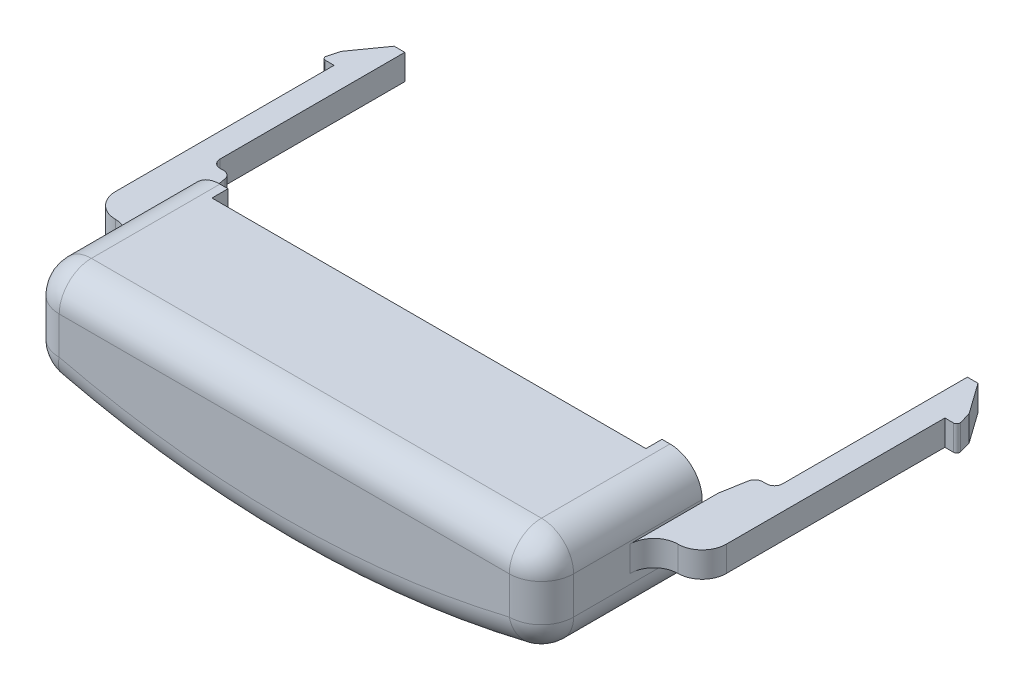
ISO-10303-21;
HEADER;
FILE_DESCRIPTION(('STEP AP214'),'2;1');
FILE_NAME('part.step','',(''),(''),'','','');
FILE_SCHEMA(('AUTOMOTIVE_DESIGN { 1 0 10303 214 1 1 1 1 }'));
ENDSEC;
DATA;
#1=APPLICATION_CONTEXT('core data for automotive mechanical design processes');
#2=APPLICATION_PROTOCOL_DEFINITION('international standard','automotive_design',2000,#1);
#3=PRODUCT_CONTEXT('',#1,'mechanical');
#4=PRODUCT('Part','Part','',(#3));
#5=PRODUCT_RELATED_PRODUCT_CATEGORY('part','',(#4));
#6=PRODUCT_DEFINITION_FORMATION('','',#4);
#7=PRODUCT_DEFINITION_CONTEXT('part definition',#1,'design');
#8=PRODUCT_DEFINITION('design','',#6,#7);
#9=PRODUCT_DEFINITION_SHAPE('','',#8);
#10=(LENGTH_UNIT() NAMED_UNIT(*) SI_UNIT(.MILLI.,.METRE.));
#11=(NAMED_UNIT(*) PLANE_ANGLE_UNIT() SI_UNIT($,.RADIAN.));
#12=(NAMED_UNIT(*) SI_UNIT($,.STERADIAN.) SOLID_ANGLE_UNIT());
#13=UNCERTAINTY_MEASURE_WITH_UNIT(LENGTH_MEASURE(1.E-05),#10,'distance_accuracy_value','');
#14=(GEOMETRIC_REPRESENTATION_CONTEXT(3) GLOBAL_UNCERTAINTY_ASSIGNED_CONTEXT((#13)) GLOBAL_UNIT_ASSIGNED_CONTEXT((#10,
#11,#12)) REPRESENTATION_CONTEXT('',''));
#15=CARTESIAN_POINT('',(0.,0.,0.));
#16=DIRECTION('',(0.,0.,1.));
#17=DIRECTION('',(1.,0.,0.));
#18=AXIS2_PLACEMENT_3D('',#15,#16,#17);
#19=CARTESIAN_POINT('',(0.,0.,10.));
#20=DIRECTION('',(0.,0.,-1.));
#21=DIRECTION('',(-1.,0.,0.));
#22=AXIS2_PLACEMENT_3D('',#19,#20,#21);
#23=CYLINDRICAL_SURFACE('',#22,60.5);
#24=CARTESIAN_POINT('',(0.,0.,0.));
#25=DIRECTION('',(0.,0.,1.));
#26=DIRECTION('',(1.,0.,0.));
#27=AXIS2_PLACEMENT_3D('',#24,#25,#26);
#28=CIRCLE('',#27,60.5);
#29=CARTESIAN_POINT('',(0.749999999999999,-60.4953510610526,0.));
#30=VERTEX_POINT('',#29);
#31=CARTESIAN_POINT('',(14.2352941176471,-58.801414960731,0.));
#32=VERTEX_POINT('',#31);
#33=EDGE_CURVE('E1136',#30,#32,#28,.T.);
#34=ORIENTED_EDGE('',*,*,#33,.F.);
#35=DIRECTION('',(0.,0.,1.));
#36=VECTOR('',#35,1.);
#37=CARTESIAN_POINT('',(0.749999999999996,-60.4953510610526,-4.));
#38=LINE('',#37,#36);
#39=CARTESIAN_POINT('',(0.749999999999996,-60.4953510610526,8.5));
#40=VERTEX_POINT('',#39);
#41=EDGE_CURVE('E1391',#30,#40,#38,.T.);
#42=ORIENTED_EDGE('',*,*,#41,.T.);
#43=CARTESIAN_POINT('',(0.,0.,8.5));
#44=DIRECTION('',(0.,0.,1.));
#45=DIRECTION('',(1.,0.,0.));
#46=AXIS2_PLACEMENT_3D('',#43,#44,#45);
#47=CIRCLE('',#46,60.5);
#48=CARTESIAN_POINT('',(14.235294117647,-58.801414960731,8.5));
#49=VERTEX_POINT('',#48);
#50=EDGE_CURVE('E923',#40,#49,#47,.T.);
#51=ORIENTED_EDGE('',*,*,#50,.T.);
#52=DIRECTION('',(0.,0.,-1.));
#53=VECTOR('',#52,1.);
#54=CARTESIAN_POINT('',(14.235294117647,-58.801414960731,10.));
#55=LINE('',#54,#53);
#56=EDGE_CURVE('E1107',#49,#32,#55,.T.);
#57=ORIENTED_EDGE('',*,*,#56,.T.);
#58=EDGE_LOOP('',(#34,#42,#51,#57));
#59=FACE_BOUND('',#58,.T.);
#60=ADVANCED_FACE('F45',(#59),#23,.F.);
#61=CARTESIAN_POINT('',(-14.235294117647,-58.801414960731,8.5));
#62=VERTEX_POINT('',#61);
#63=CARTESIAN_POINT('',(-0.750000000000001,-60.4953510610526,8.5));
#64=VERTEX_POINT('',#63);
#65=EDGE_CURVE('E924',#62,#64,#47,.T.);
#66=ORIENTED_EDGE('',*,*,#65,.T.);
#67=DIRECTION('',(0.,0.,1.));
#68=VECTOR('',#67,1.);
#69=CARTESIAN_POINT('',(-0.750000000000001,-60.4953510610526,-4.));
#70=LINE('',#69,#68);
#71=CARTESIAN_POINT('',(-0.750000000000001,-60.4953510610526,0.));
#72=VERTEX_POINT('',#71);
#73=EDGE_CURVE('E473',#72,#64,#70,.T.);
#74=ORIENTED_EDGE('',*,*,#73,.F.);
#75=CARTESIAN_POINT('',(-14.2352941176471,-58.801414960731,0.));
#76=VERTEX_POINT('',#75);
#77=EDGE_CURVE('E1112',#76,#72,#28,.T.);
#78=ORIENTED_EDGE('',*,*,#77,.F.);
#79=DIRECTION('',(0.,0.,-1.));
#80=VECTOR('',#79,1.);
#81=CARTESIAN_POINT('',(-14.235294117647,-58.801414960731,10.));
#82=LINE('',#81,#80);
#83=EDGE_CURVE('E1111',#62,#76,#82,.T.);
#84=ORIENTED_EDGE('',*,*,#83,.F.);
#85=EDGE_LOOP('',(#66,#74,#78,#84));
#86=FACE_BOUND('',#85,.T.);
#87=ADVANCED_FACE('F671',(#86),#23,.F.);
#88=CARTESIAN_POINT('',(14.,-57.8294907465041,9.));
#89=DIRECTION('',(0.,0.,1.));
#90=DIRECTION('',(1.,0.,0.));
#91=AXIS2_PLACEMENT_3D('',#88,#89,#90);
#92=PLANE('',#91);
#93=DIRECTION('',(0.,-1.,0.));
#94=VECTOR('',#93,1.);
#95=CARTESIAN_POINT('',(0.749999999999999,-58.9953510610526,9.));
#96=LINE('',#95,#94);
#97=CARTESIAN_POINT('',(0.749999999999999,-58.9953510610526,9.));
#98=VERTEX_POINT('',#97);
#99=CARTESIAN_POINT('',(0.749999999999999,-59.9953123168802,9.));
#100=VERTEX_POINT('',#99);
#101=EDGE_CURVE('E468',#98,#100,#96,.T.);
#102=ORIENTED_EDGE('',*,*,#101,.F.);
#103=DIRECTION('',(1.,0.,0.));
#104=VECTOR('',#103,1.);
#105=CARTESIAN_POINT('',(0.749999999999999,-58.9953510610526,9.));
#106=LINE('',#105,#104);
#107=CARTESIAN_POINT('',(-0.750000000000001,-58.9953510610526,9.));
#108=VERTEX_POINT('',#107);
#109=EDGE_CURVE('E465',#108,#98,#106,.T.);
#110=ORIENTED_EDGE('',*,*,#109,.F.);
#111=DIRECTION('',(0.,1.,0.));
#112=VECTOR('',#111,1.);
#113=CARTESIAN_POINT('',(-0.750000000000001,-58.9953510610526,9.));
#114=LINE('',#113,#112);
#115=CARTESIAN_POINT('',(-0.750000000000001,-59.9953123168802,9.));
#116=VERTEX_POINT('',#115);
#117=EDGE_CURVE('E461',#116,#108,#114,.T.);
#118=ORIENTED_EDGE('',*,*,#117,.F.);
#119=CARTESIAN_POINT('',(0.,0.,9.));
#120=DIRECTION('',(0.,0.,1.));
#121=DIRECTION('',(1.,0.,0.));
#122=AXIS2_PLACEMENT_3D('',#119,#120,#121);
#123=CIRCLE('',#122,60.);
#124=CARTESIAN_POINT('',(-14.1176470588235,-58.3154528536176,9.));
#125=VERTEX_POINT('',#124);
#126=EDGE_CURVE('E444',#116,#125,#123,.F.);
#127=ORIENTED_EDGE('',*,*,#126,.T.);
#128=CARTESIAN_POINT('',(-14.,-57.8294907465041,9.));
#129=DIRECTION('',(0.,0.,1.));
#130=DIRECTION('',(1.,0.,0.));
#131=AXIS2_PLACEMENT_3D('',#128,#129,#130);
#132=CIRCLE('',#131,0.500000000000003);
#133=CARTESIAN_POINT('',(-14.5,-57.8294907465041,9.));
#134=VERTEX_POINT('',#133);
#135=EDGE_CURVE('E1350',#125,#134,#132,.F.);
#136=ORIENTED_EDGE('',*,*,#135,.T.);
#137=DIRECTION('',(0.,-1.,0.));
#138=VECTOR('',#137,1.);
#139=CARTESIAN_POINT('',(-14.5,-57.8294907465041,9.));
#140=LINE('',#139,#138);
#141=CARTESIAN_POINT('',(-14.5,-55.5,9.));
#142=VERTEX_POINT('',#141);
#143=EDGE_CURVE('E1353',#134,#142,#140,.F.);
#144=ORIENTED_EDGE('',*,*,#143,.T.);
#145=CARTESIAN_POINT('',(-14.,-55.5,9.));
#146=DIRECTION('',(0.,0.,1.));
#147=DIRECTION('',(1.,0.,0.));
#148=AXIS2_PLACEMENT_3D('',#145,#146,#147);
#149=CIRCLE('',#148,0.500000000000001);
#150=CARTESIAN_POINT('',(-14.,-55.,9.));
#151=VERTEX_POINT('',#150);
#152=EDGE_CURVE('E906',#142,#151,#149,.F.);
#153=ORIENTED_EDGE('',*,*,#152,.T.);
#154=DIRECTION('',(-1.,0.,0.));
#155=VECTOR('',#154,1.);
#156=CARTESIAN_POINT('',(14.,-55.,9.));
#157=LINE('',#156,#155);
#158=CARTESIAN_POINT('',(14.,-55.,9.));
#159=VERTEX_POINT('',#158);
#160=EDGE_CURVE('E789',#151,#159,#157,.F.);
#161=ORIENTED_EDGE('',*,*,#160,.T.);
#162=CARTESIAN_POINT('',(14.,-55.5,9.));
#163=DIRECTION('',(0.,0.,1.));
#164=DIRECTION('',(1.,0.,0.));
#165=AXIS2_PLACEMENT_3D('',#162,#163,#164);
#166=CIRCLE('',#165,0.500000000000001);
#167=CARTESIAN_POINT('',(14.5,-55.5,9.));
#168=VERTEX_POINT('',#167);
#169=EDGE_CURVE('E898',#159,#168,#166,.F.);
#170=ORIENTED_EDGE('',*,*,#169,.T.);
#171=DIRECTION('',(0.,1.,0.));
#172=VECTOR('',#171,1.);
#173=CARTESIAN_POINT('',(14.5,-57.8294907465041,9.));
#174=LINE('',#173,#172);
#175=CARTESIAN_POINT('',(14.5,-57.8294907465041,9.));
#176=VERTEX_POINT('',#175);
#177=EDGE_CURVE('E901',#168,#176,#174,.F.);
#178=ORIENTED_EDGE('',*,*,#177,.T.);
#179=CARTESIAN_POINT('',(14.,-57.8294907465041,9.));
#180=DIRECTION('',(0.,0.,1.));
#181=DIRECTION('',(1.,0.,0.));
#182=AXIS2_PLACEMENT_3D('',#179,#180,#181);
#183=CIRCLE('',#182,0.500000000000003);
#184=CARTESIAN_POINT('',(14.1176470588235,-58.3154528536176,9.));
#185=VERTEX_POINT('',#184);
#186=EDGE_CURVE('E457',#176,#185,#183,.F.);
#187=ORIENTED_EDGE('',*,*,#186,.T.);
#188=EDGE_CURVE('E456',#185,#100,#123,.F.);
#189=ORIENTED_EDGE('',*,*,#188,.T.);
#190=EDGE_LOOP('',(#102,#110,#118,#127,#136,#144,#153,#161,#170,#178,#187,#189));
#191=FACE_BOUND('',#190,.T.);
#192=ADVANCED_FACE('F463',(#191),#92,.F.);
#193=CARTESIAN_POINT('',(0.,0.,8.5));
#194=DIRECTION('',(0.,0.,1.));
#195=DIRECTION('',(1.,0.,0.));
#196=AXIS2_PLACEMENT_3D('',#193,#194,#195);
#197=TOROIDAL_SURFACE('',#196,60.,0.5);
#198=CARTESIAN_POINT('',(0.749999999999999,-60.4595865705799,8.6856955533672));
#199=CARTESIAN_POINT('',(0.749999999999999,-60.4700159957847,8.6596206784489));
#200=CARTESIAN_POINT('',(0.749999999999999,-60.4782510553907,8.63264606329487));
#201=CARTESIAN_POINT('',(0.749999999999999,-60.4900818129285,8.57767456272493));
#202=CARTESIAN_POINT('',(0.749999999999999,-60.4936719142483,8.54967648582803));
#203=CARTESIAN_POINT('',(0.749999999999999,-60.4960982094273,8.49348583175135));
#204=CARTESIAN_POINT('',(0.749999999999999,-60.4949366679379,8.46529335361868));
#205=CARTESIAN_POINT('',(0.749999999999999,-60.4878969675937,8.40951135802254));
#206=CARTESIAN_POINT('',(0.749999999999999,-60.4820199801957,8.38192169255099));
#207=CARTESIAN_POINT('',(0.749999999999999,-60.4657173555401,8.32811748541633));
#208=CARTESIAN_POINT('',(0.749999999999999,-60.455291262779,8.30190308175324));
#209=CARTESIAN_POINT('',(0.749999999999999,-60.4301857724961,8.25159566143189));
#210=CARTESIAN_POINT('',(0.749999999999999,-60.4155062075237,8.22750272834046));
#211=CARTESIAN_POINT('',(0.749999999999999,-60.3823104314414,8.18212265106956));
#212=CARTESIAN_POINT('',(0.749999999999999,-60.3637941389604,8.16083556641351));
#213=CARTESIAN_POINT('',(0.749999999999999,-60.3234508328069,8.12167193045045));
#214=CARTESIAN_POINT('',(0.749999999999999,-60.3016238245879,8.10379537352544));
#215=CARTESIAN_POINT('',(0.749999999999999,-60.2552769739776,8.0719588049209));
#216=CARTESIAN_POINT('',(0.749999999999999,-60.2307569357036,8.05799907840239));
#217=CARTESIAN_POINT('',(0.749999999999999,-60.1797214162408,8.03439401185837));
#218=CARTESIAN_POINT('',(0.749999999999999,-60.1532059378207,8.0247486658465));
#219=CARTESIAN_POINT('',(0.749999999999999,-60.0989301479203,8.0100454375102));
#220=CARTESIAN_POINT('',(0.749999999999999,-60.071169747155,8.00498788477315));
#221=CARTESIAN_POINT('',(0.749999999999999,-60.015193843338,7.99960492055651));
#222=CARTESIAN_POINT('',(0.749999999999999,-59.9869783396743,7.99927951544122));
#223=CARTESIAN_POINT('',(0.749999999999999,-59.930892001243,8.00337017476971));
#224=CARTESIAN_POINT('',(0.749999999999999,-59.9030211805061,8.00778643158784));
#225=CARTESIAN_POINT('',(0.749999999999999,-59.8484165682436,8.02123540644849));
#226=CARTESIAN_POINT('',(0.749999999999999,-59.821682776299,8.03026812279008));
#227=CARTESIAN_POINT('',(0.749999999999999,-59.7701113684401,8.05269361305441));
#228=CARTESIAN_POINT('',(0.749999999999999,-59.7452737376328,8.0660863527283));
#229=CARTESIAN_POINT('',(0.749999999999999,-59.6981996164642,8.09685184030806));
#230=CARTESIAN_POINT('',(0.749999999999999,-59.6759631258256,8.11422458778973));
#231=CARTESIAN_POINT('',(0.749999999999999,-59.634723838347,8.15245596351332));
#232=CARTESIAN_POINT('',(0.749999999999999,-59.6157208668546,8.17331440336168));
#233=CARTESIAN_POINT('',(0.749999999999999,-59.5814868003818,8.21792576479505));
#234=CARTESIAN_POINT('',(0.749999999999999,-59.5662557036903,8.24167868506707));
#235=CARTESIAN_POINT('',(0.749999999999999,-59.539998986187,8.29140278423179));
#236=CARTESIAN_POINT('',(0.749999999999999,-59.5289730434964,8.31737379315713));
#237=CARTESIAN_POINT('',(0.749999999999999,-59.5114381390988,8.37079836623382));
#238=CARTESIAN_POINT('',(0.749999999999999,-59.504929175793,8.39825192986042));
#239=CARTESIAN_POINT('',(0.749999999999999,-59.4966133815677,8.45386036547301));
#240=CARTESIAN_POINT('',(0.749999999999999,-59.4948062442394,8.48201519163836));
#241=CARTESIAN_POINT('',(0.749999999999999,-59.495944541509,8.53822859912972));
#242=CARTESIAN_POINT('',(0.749999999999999,-59.4988899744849,8.56628718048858));
#243=CARTESIAN_POINT('',(0.749999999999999,-59.5094496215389,8.62151088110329));
#244=CARTESIAN_POINT('',(0.749999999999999,-59.5170637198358,8.64867602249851));
#245=CARTESIAN_POINT('',(0.749999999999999,-59.5367443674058,8.70134249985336));
#246=CARTESIAN_POINT('',(0.749999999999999,-59.5488109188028,8.7268438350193));
#247=CARTESIAN_POINT('',(0.749999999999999,-59.5770542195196,8.77545956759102));
#248=CARTESIAN_POINT('',(0.749999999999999,-59.5932310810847,8.79857389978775));
#249=CARTESIAN_POINT('',(0.749999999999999,-59.6292355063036,8.84175883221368));
#250=CARTESIAN_POINT('',(0.749999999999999,-59.6490630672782,8.86182943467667));
#251=CARTESIAN_POINT('',(0.749999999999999,-59.6918074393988,8.89835863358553));
#252=CARTESIAN_POINT('',(0.749999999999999,-59.7147244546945,8.91481699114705));
#253=CARTESIAN_POINT('',(0.749999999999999,-59.7629962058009,8.94365304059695));
#254=CARTESIAN_POINT('',(0.749999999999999,-59.7883509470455,8.95603072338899));
#255=CARTESIAN_POINT('',(0.749999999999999,-59.8407803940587,8.97635496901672));
#256=CARTESIAN_POINT('',(0.749999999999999,-59.8678552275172,8.98430120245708));
#257=CARTESIAN_POINT('',(0.749999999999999,-59.9229546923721,8.99553568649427));
#258=CARTESIAN_POINT('',(0.749999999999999,-59.9509793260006,8.99882392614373));
#259=CARTESIAN_POINT('',(0.749999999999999,-60.0071848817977,9.00064917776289));
#260=CARTESIAN_POINT('',(0.749999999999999,-60.0353658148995,8.99918585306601));
#261=CARTESIAN_POINT('',(0.749999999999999,-60.0910809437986,8.99154883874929));
#262=CARTESIAN_POINT('',(0.749999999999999,-60.1186151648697,8.98537533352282));
#263=CARTESIAN_POINT('',(0.749999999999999,-60.1722536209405,8.96849441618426));
#264=CARTESIAN_POINT('',(0.749999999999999,-60.1983579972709,8.95778745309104));
#265=CARTESIAN_POINT('',(0.749999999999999,-60.248405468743,8.93213937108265));
#266=CARTESIAN_POINT('',(0.749999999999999,-60.2723480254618,8.91719720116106));
#267=CARTESIAN_POINT('',(0.749999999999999,-60.3173926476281,8.88349985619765));
#268=CARTESIAN_POINT('',(0.749999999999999,-60.3384934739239,8.86474302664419));
#269=CARTESIAN_POINT('',(0.749999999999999,-60.3772254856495,8.8239658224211));
#270=CARTESIAN_POINT('',(0.749999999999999,-60.3948608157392,8.80194940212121));
#271=CARTESIAN_POINT('',(0.749999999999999,-60.4202977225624,8.76405359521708));
#272=CARTESIAN_POINT('',(0.749999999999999,-60.4293067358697,8.74896965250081));
#273=CARTESIAN_POINT('',(0.749999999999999,-60.4456917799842,8.71793949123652));
#274=CARTESIAN_POINT('',(0.749999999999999,-60.4530678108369,8.70199327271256));
#275=CARTESIAN_POINT('',(0.749999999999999,-60.4595865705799,8.6856955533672));
#276=B_SPLINE_CURVE_WITH_KNOTS('',3,(#198,#199,#200,#201,#202,#203,#204,#205,#206,#207,#208,
#209,#210,#211,#212,#213,#214,#215,#216,#217,#218,#219,#220,#221,#222,#223,#224,#225,#226,#227,
#228,#229,#230,#231,#232,#233,#234,#235,#236,#237,#238,#239,#240,#241,#242,#243,#244,#245,#246,
#247,#248,#249,#250,#251,#252,#253,#254,#255,#256,#257,#258,#259,#260,#261,#262,#263,#264,#265,
#266,#267,#268,#269,#270,#271,#272,#273,#274,#275),.UNSPECIFIED.,.T.,.F.,(4,2,2,2,2,2,2,2,2,2,2,
2,2,2,2,2,2,2,2,2,2,2,2,2,2,2,2,2,2,2,2,2,2,2,2,2,2,2,4),(0.,0.0841858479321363,
0.168473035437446,0.252720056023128,0.336946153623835,0.421180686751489,0.505418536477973,
0.589658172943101,0.673897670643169,0.758143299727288,0.842388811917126,0.926640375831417,
1.0108920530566,1.09514714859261,1.17940221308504,1.26365661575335,1.34791100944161,
1.43216085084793,1.51641065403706,1.60065400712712,1.68489733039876,1.76913516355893,
1.85337296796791,1.93760868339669,2.02184443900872,2.10608249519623,2.19032048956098,
2.27456405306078,2.35880780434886,2.44305781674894,2.52730802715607,2.61156420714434,
2.69581708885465,2.78006162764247,2.86432709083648,2.94862918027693,3.0328298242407,
3.08544895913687,3.13806809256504),.UNSPECIFIED.);
#277=EDGE_CURVE('E475',#100,#40,#276,.T.);
#278=ORIENTED_EDGE('',*,*,#277,.F.);
#279=ORIENTED_EDGE('',*,*,#188,.F.);
#280=CARTESIAN_POINT('',(14.1176470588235,-58.3154528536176,8.5));
#281=DIRECTION('',(-0.971924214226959,-0.23529411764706,0.));
#282=DIRECTION('',(0.23529411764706,-0.971924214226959,0.));
#283=AXIS2_PLACEMENT_3D('',#280,#281,#282);
#284=CIRCLE('',#283,0.5);
#285=EDGE_CURVE('E793',#49,#185,#284,.T.);
#286=ORIENTED_EDGE('',*,*,#285,.F.);
#287=ORIENTED_EDGE('',*,*,#50,.F.);
#288=EDGE_LOOP('',(#278,#279,#286,#287));
#289=FACE_BOUND('',#288,.T.);
#290=ADVANCED_FACE('F498',(#289),#197,.F.);
#291=CARTESIAN_POINT('',(-0.750000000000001,-60.4595865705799,8.6856955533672));
#292=CARTESIAN_POINT('',(-0.750000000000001,-60.4491540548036,8.71177144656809));
#293=CARTESIAN_POINT('',(-0.750000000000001,-60.4365117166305,8.73698528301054));
#294=CARTESIAN_POINT('',(-0.750000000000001,-60.4071622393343,8.78495317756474));
#295=CARTESIAN_POINT('',(-0.750000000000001,-60.3904502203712,8.80770423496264));
#296=CARTESIAN_POINT('',(-0.750000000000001,-60.3534496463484,8.85006816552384));
#297=CARTESIAN_POINT('',(-0.750000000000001,-60.3331628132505,8.86968254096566));
#298=CARTESIAN_POINT('',(-0.750000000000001,-60.2895896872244,8.90522162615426));
#299=CARTESIAN_POINT('',(-0.750000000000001,-60.2663041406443,8.92114725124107));
#300=CARTESIAN_POINT('',(-0.750000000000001,-60.217386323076,8.94886649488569));
#301=CARTESIAN_POINT('',(-0.750000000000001,-60.1917536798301,8.96065945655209));
#302=CARTESIAN_POINT('',(-0.750000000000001,-60.1388714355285,8.97977538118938));
#303=CARTESIAN_POINT('',(-0.750000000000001,-60.1116217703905,8.98709816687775));
#304=CARTESIAN_POINT('',(-0.750000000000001,-60.056278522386,8.99706556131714));
#305=CARTESIAN_POINT('',(-0.750000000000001,-60.0281848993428,8.9997099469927));
#306=CARTESIAN_POINT('',(-0.750000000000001,-59.9719524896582,9.00024481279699));
#307=CARTESIAN_POINT('',(-0.750000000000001,-59.943813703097,8.99813530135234));
#308=CARTESIAN_POINT('',(-0.750000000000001,-59.8882887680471,8.98922210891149));
#309=CARTESIAN_POINT('',(-0.750000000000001,-59.860902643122,8.98241828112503));
#310=CARTESIAN_POINT('',(-0.750000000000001,-59.8076614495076,8.96430937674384));
#311=CARTESIAN_POINT('',(-0.750000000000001,-59.7818063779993,8.95300430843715));
#312=CARTESIAN_POINT('',(-0.750000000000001,-59.7323617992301,8.92621401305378));
#313=CARTESIAN_POINT('',(-0.750000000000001,-59.708772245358,8.91072887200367));
#314=CARTESIAN_POINT('',(-0.750000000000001,-59.6645278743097,8.87601778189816));
#315=CARTESIAN_POINT('',(-0.750000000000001,-59.6438730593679,8.85679182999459));
#316=CARTESIAN_POINT('',(-0.750000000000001,-59.6060859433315,8.81514616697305));
#317=CARTESIAN_POINT('',(-0.750000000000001,-59.5889534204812,8.79272665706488));
#318=CARTESIAN_POINT('',(-0.750000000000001,-59.5586958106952,8.74532937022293));
#319=CARTESIAN_POINT('',(-0.750000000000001,-59.5455707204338,8.72035159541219));
#320=CARTESIAN_POINT('',(-0.750000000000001,-59.5237015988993,8.66854887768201));
#321=CARTESIAN_POINT('',(-0.750000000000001,-59.5149572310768,8.64172407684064));
#322=CARTESIAN_POINT('',(-0.750000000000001,-59.5020963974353,8.58698711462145));
#323=CARTESIAN_POINT('',(-0.750000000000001,-59.497979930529,8.55907495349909));
#324=CARTESIAN_POINT('',(-0.750000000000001,-59.4944919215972,8.50295732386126));
#325=CARTESIAN_POINT('',(-0.750000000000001,-59.4951201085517,8.47475187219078));
#326=CARTESIAN_POINT('',(-0.750000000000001,-59.5011029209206,8.41884678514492));
#327=CARTESIAN_POINT('',(-0.750000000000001,-59.5064575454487,8.3911471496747));
#328=CARTESIAN_POINT('',(-0.750000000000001,-59.5217410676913,8.33704031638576));
#329=CARTESIAN_POINT('',(-0.750000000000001,-59.5316699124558,8.31063310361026));
#330=CARTESIAN_POINT('',(-0.750000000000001,-59.5558199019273,8.25986030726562));
#331=CARTESIAN_POINT('',(-0.750000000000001,-59.570041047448,8.23549472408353));
#332=CARTESIAN_POINT('',(-0.750000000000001,-59.6023724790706,8.1894957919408));
#333=CARTESIAN_POINT('',(-0.750000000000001,-59.6204829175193,8.16786255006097));
#334=CARTESIAN_POINT('',(-0.750000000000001,-59.6600784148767,8.1279433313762));
#335=CARTESIAN_POINT('',(-0.750000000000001,-59.6815634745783,8.10965735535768));
#336=CARTESIAN_POINT('',(-0.750000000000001,-59.7272999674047,8.07695033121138));
#337=CARTESIAN_POINT('',(-0.750000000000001,-59.7515515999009,8.0625295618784));
#338=CARTESIAN_POINT('',(-0.750000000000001,-59.802131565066,8.03796385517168));
#339=CARTESIAN_POINT('',(-0.750000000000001,-59.8284598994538,8.02781892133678));
#340=CARTESIAN_POINT('',(-0.750000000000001,-59.8824479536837,8.01209213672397));
#341=CARTESIAN_POINT('',(-0.750000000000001,-59.9101077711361,8.00651062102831));
#342=CARTESIAN_POINT('',(-0.750000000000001,-59.9659718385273,8.00007028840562));
#343=CARTESIAN_POINT('',(-0.750000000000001,-59.9941760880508,7.99921146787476));
#344=CARTESIAN_POINT('',(-0.750000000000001,-60.050329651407,8.00224094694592));
#345=CARTESIAN_POINT('',(-0.750000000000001,-60.0782789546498,8.00612944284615));
#346=CARTESIAN_POINT('',(-0.750000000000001,-60.1331280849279,8.018543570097));
#347=CARTESIAN_POINT('',(-0.750000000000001,-60.1600279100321,8.02706920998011));
#348=CARTESIAN_POINT('',(-0.750000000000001,-60.2120141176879,8.04851560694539));
#349=CARTESIAN_POINT('',(-0.750000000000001,-60.2371005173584,8.06143632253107));
#350=CARTESIAN_POINT('',(-0.750000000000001,-60.2847479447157,8.09130625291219));
#351=CARTESIAN_POINT('',(-0.750000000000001,-60.3073089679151,8.10825547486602));
#352=CARTESIAN_POINT('',(-0.750000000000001,-60.3492642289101,8.14570067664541));
#353=CARTESIAN_POINT('',(-0.750000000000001,-60.3686585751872,8.16619653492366));
#354=CARTESIAN_POINT('',(-0.750000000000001,-60.4037299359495,8.21015282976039));
#355=CARTESIAN_POINT('',(-0.750000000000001,-60.4194070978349,8.23361314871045));
#356=CARTESIAN_POINT('',(-0.750000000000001,-60.446597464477,8.28282832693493));
#357=CARTESIAN_POINT('',(-0.750000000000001,-60.4581114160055,8.30858277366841));
#358=CARTESIAN_POINT('',(-0.750000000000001,-60.4766544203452,8.36166643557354));
#359=CARTESIAN_POINT('',(-0.750000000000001,-60.4836823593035,8.38899604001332));
#360=CARTESIAN_POINT('',(-0.750000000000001,-60.4930520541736,8.44445605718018));
#361=CARTESIAN_POINT('',(-0.750000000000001,-60.4953918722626,8.47258679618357));
#362=CARTESIAN_POINT('',(-0.750000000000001,-60.4953092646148,8.52881801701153));
#363=CARTESIAN_POINT('',(-0.750000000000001,-60.4928925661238,8.55691849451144));
#364=CARTESIAN_POINT('',(-0.750000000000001,-60.4851735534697,8.60189119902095));
#365=CARTESIAN_POINT('',(-0.750000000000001,-60.4812941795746,8.61902032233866));
#366=CARTESIAN_POINT('',(-0.750000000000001,-60.4717595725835,8.65277697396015));
#367=CARTESIAN_POINT('',(-0.750000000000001,-60.4661043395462,8.66940450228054));
#368=CARTESIAN_POINT('',(-0.750000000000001,-60.4595865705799,8.6856955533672));
#369=B_SPLINE_CURVE_WITH_KNOTS('',3,(#291,#292,#293,#294,#295,#296,#297,#298,#299,#300,#301,
#302,#303,#304,#305,#306,#307,#308,#309,#310,#311,#312,#313,#314,#315,#316,#317,#318,#319,#320,
#321,#322,#323,#324,#325,#326,#327,#328,#329,#330,#331,#332,#333,#334,#335,#336,#337,#338,#339,
#340,#341,#342,#343,#344,#345,#346,#347,#348,#349,#350,#351,#352,#353,#354,#355,#356,#357,#358,
#359,#360,#361,#362,#363,#364,#365,#366,#367,#368),.UNSPECIFIED.,.T.,.F.,(4,2,2,2,2,2,2,2,2,2,2,
2,2,2,2,2,2,2,2,2,2,2,2,2,2,2,2,2,2,2,2,2,2,2,2,2,2,2,4),(0.,0.0841921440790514,
0.168485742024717,0.252738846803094,0.336971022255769,0.421216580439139,0.50546547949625,
0.589718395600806,0.673971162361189,0.758226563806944,0.842481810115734,0.92673532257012,
1.0109888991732,1.09523716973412,1.17948537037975,1.26372709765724,1.34796880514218,
1.43220570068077,1.51644258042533,1.60067848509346,1.68491440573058,1.76915362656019,
1.85339286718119,1.93763818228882,2.02188356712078,2.10613513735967,2.19038664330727,
2.27464163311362,2.35889677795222,2.44315112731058,2.52740562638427,2.61165723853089,
2.6959055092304,2.7801386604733,2.86439271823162,2.94868159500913,3.03286904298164,
3.08546852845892,3.13806801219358),.UNSPECIFIED.);
#370=EDGE_CURVE('E449',#64,#116,#369,.T.);
#371=ORIENTED_EDGE('',*,*,#370,.F.);
#372=ORIENTED_EDGE('',*,*,#65,.F.);
#373=CARTESIAN_POINT('',(-14.1176470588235,-58.3154528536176,8.5));
#374=DIRECTION('',(-0.971924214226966,0.235294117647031,0.));
#375=DIRECTION('',(-0.235294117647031,-0.971924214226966,0.));
#376=AXIS2_PLACEMENT_3D('',#373,#374,#375);
#377=CIRCLE('',#376,0.5);
#378=EDGE_CURVE('E452',#62,#125,#377,.T.);
#379=ORIENTED_EDGE('',*,*,#378,.T.);
#380=ORIENTED_EDGE('',*,*,#126,.F.);
#381=EDGE_LOOP('',(#371,#372,#379,#380));
#382=FACE_BOUND('',#381,.T.);
#383=ADVANCED_FACE('F446',(#382),#197,.F.);
#384=CARTESIAN_POINT('',(16.0000000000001,0.,0.));
#385=DIRECTION('',(-1.,0.,0.));
#386=DIRECTION('',(0.,1.,0.));
#387=AXIS2_PLACEMENT_3D('',#384,#385,#386);
#388=PLANE('',#387);
#389=DIRECTION('',(0.,0.,-1.));
#390=VECTOR('',#389,1.);
#391=CARTESIAN_POINT('',(15.9999999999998,-55.6499999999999,3.));
#392=LINE('',#391,#390);
#393=CARTESIAN_POINT('',(15.9999999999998,-55.6499999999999,0.));
#394=VERTEX_POINT('',#393);
#395=CARTESIAN_POINT('',(15.9999999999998,-55.6499999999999,-0.999999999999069));
#396=VERTEX_POINT('',#395);
#397=EDGE_CURVE('E1031',#394,#396,#392,.T.);
#398=ORIENTED_EDGE('',*,*,#397,.T.);
#399=DIRECTION('',(0.,-1.,0.));
#400=VECTOR('',#399,1.);
#401=CARTESIAN_POINT('',(16.0000000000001,0.,-0.999999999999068));
#402=LINE('',#401,#400);
#403=CARTESIAN_POINT('',(15.9999999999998,-57.2322364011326,-0.999999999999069));
#404=VERTEX_POINT('',#403);
#405=EDGE_CURVE('E1288',#396,#404,#402,.T.);
#406=ORIENTED_EDGE('',*,*,#405,.T.);
#407=DIRECTION('',(0.,0.,1.));
#408=VECTOR('',#407,1.);
#409=CARTESIAN_POINT('',(15.9999999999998,-57.2322364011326,3.));
#410=LINE('',#409,#408);
#411=CARTESIAN_POINT('',(16.,-57.2322364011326,0.));
#412=VERTEX_POINT('',#411);
#413=EDGE_CURVE('E1028',#404,#412,#410,.T.);
#414=ORIENTED_EDGE('',*,*,#413,.T.);
#415=DIRECTION('',(0.,1.,0.));
#416=VECTOR('',#415,1.);
#417=CARTESIAN_POINT('',(16.,-57.8294907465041,0.));
#418=LINE('',#417,#416);
#419=EDGE_CURVE('E1170',#412,#394,#418,.T.);
#420=ORIENTED_EDGE('',*,*,#419,.T.);
#421=EDGE_LOOP('',(#398,#406,#414,#420));
#422=FACE_BOUND('',#421,.T.);
#423=ADVANCED_FACE('F586',(#422),#388,.T.);
#424=CARTESIAN_POINT('',(18.9999999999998,-57.2322364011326,3.));
#425=DIRECTION('',(0.,-1.,0.));
#426=DIRECTION('',(1.,0.,0.));
#427=AXIS2_PLACEMENT_3D('',#424,#425,#426);
#428=PLANE('',#427);
#429=DIRECTION('',(-0.173648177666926,0.,0.984807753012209));
#430=VECTOR('',#429,1.);
#431=CARTESIAN_POINT('',(15.4064207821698,-57.2322364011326,2.36635502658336));
#432=LINE('',#431,#430);
#433=CARTESIAN_POINT('',(16.2797999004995,-57.2322364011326,-2.58682408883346));
#434=VERTEX_POINT('',#433);
#435=EDGE_CURVE('E1291',#404,#434,#432,.F.);
#436=ORIENTED_EDGE('',*,*,#435,.T.);
#437=CARTESIAN_POINT('',(16.7722037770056,-57.2322364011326,-2.5));
#438=DIRECTION('',(0.,-1.,0.));
#439=DIRECTION('',(1.,0.,0.));
#440=AXIS2_PLACEMENT_3D('',#437,#438,#439);
#441=CIRCLE('',#440,0.5);
#442=CARTESIAN_POINT('',(16.7722037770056,-57.2322364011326,-3.));
#443=VERTEX_POINT('',#442);
#444=EDGE_CURVE('E943',#434,#443,#441,.T.);
#445=ORIENTED_EDGE('',*,*,#444,.T.);
#446=DIRECTION('',(1.,0.,0.));
#447=VECTOR('',#446,1.);
#448=CARTESIAN_POINT('',(16.,-57.2322364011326,-3.));
#449=LINE('',#448,#447);
#450=CARTESIAN_POINT('',(17.,-57.2322364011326,-3.));
#451=VERTEX_POINT('',#450);
#452=EDGE_CURVE('E989',#443,#451,#449,.T.);
#453=ORIENTED_EDGE('',*,*,#452,.T.);
#454=CARTESIAN_POINT('',(17.,-57.2322364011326,-3.5));
#455=DIRECTION('',(0.,-1.,0.));
#456=DIRECTION('',(1.,0.,0.));
#457=AXIS2_PLACEMENT_3D('',#454,#455,#456);
#458=CIRCLE('',#457,0.5);
#459=CARTESIAN_POINT('',(17.5,-57.2322364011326,-3.5));
#460=VERTEX_POINT('',#459);
#461=EDGE_CURVE('E817',#451,#460,#458,.F.);
#462=ORIENTED_EDGE('',*,*,#461,.T.);
#463=DIRECTION('',(0.,0.,-1.));
#464=VECTOR('',#463,1.);
#465=CARTESIAN_POINT('',(17.5,-57.2322364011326,-15.));
#466=LINE('',#465,#464);
#467=CARTESIAN_POINT('',(17.5,-57.2322364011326,-15.));
#468=VERTEX_POINT('',#467);
#469=EDGE_CURVE('E986',#460,#468,#466,.T.);
#470=ORIENTED_EDGE('',*,*,#469,.T.);
#471=DIRECTION('',(-1.,0.,0.));
#472=VECTOR('',#471,1.);
#473=CARTESIAN_POINT('',(18.9999999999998,-57.2322364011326,-15.));
#474=LINE('',#473,#472);
#475=CARTESIAN_POINT('',(18.1605875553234,-57.2322364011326,-15.));
#476=VERTEX_POINT('',#475);
#477=EDGE_CURVE('E1037',#476,#468,#474,.T.);
#478=ORIENTED_EDGE('',*,*,#477,.F.);
#479=DIRECTION('',(0.579596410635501,0.,0.814903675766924));
#480=VECTOR('',#479,1.);
#481=CARTESIAN_POINT('',(26.9442474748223,-57.2322364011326,-2.65030869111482));
#482=LINE('',#481,#480);
#483=CARTESIAN_POINT('',(19.5318579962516,-57.2322364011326,-13.0720147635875));
#484=VERTEX_POINT('',#483);
#485=EDGE_CURVE('E1276',#476,#484,#482,.T.);
#486=ORIENTED_EDGE('',*,*,#485,.T.);
#487=DIRECTION('',(-0.265928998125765,0.,-0.963992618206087));
#488=VECTOR('',#487,1.);
#489=CARTESIAN_POINT('',(19.,-57.2322364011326,-15.));
#490=LINE('',#489,#488);
#491=CARTESIAN_POINT('',(19.7301556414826,-57.2322364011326,-12.3531857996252));
#492=VERTEX_POINT('',#491);
#493=EDGE_CURVE('E1005',#492,#484,#490,.T.);
#494=ORIENTED_EDGE('',*,*,#493,.F.);
#495=CARTESIAN_POINT('',(19.5373571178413,-57.2322364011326,-12.3));
#496=DIRECTION('',(0.,-1.,0.));
#497=DIRECTION('',(1.,0.,0.));
#498=AXIS2_PLACEMENT_3D('',#495,#496,#497);
#499=CIRCLE('',#498,0.2);
#500=CARTESIAN_POINT('',(19.5373571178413,-57.2322364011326,-12.1));
#501=VERTEX_POINT('',#500);
#502=EDGE_CURVE('E1269',#492,#501,#499,.T.);
#503=ORIENTED_EDGE('',*,*,#502,.T.);
#504=DIRECTION('',(1.,0.,0.));
#505=VECTOR('',#504,1.);
#506=CARTESIAN_POINT('',(19.7999999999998,-57.2322364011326,-12.1));
#507=LINE('',#506,#505);
#508=CARTESIAN_POINT('',(18.9999999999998,-57.2322364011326,-12.1));
#509=VERTEX_POINT('',#508);
#510=EDGE_CURVE('E1011',#509,#501,#507,.T.);
#511=ORIENTED_EDGE('',*,*,#510,.F.);
#512=DIRECTION('',(0.,0.,1.));
#513=VECTOR('',#512,1.);
#514=CARTESIAN_POINT('',(18.9999999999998,-57.2322364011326,3.));
#515=LINE('',#514,#513);
#516=CARTESIAN_POINT('',(18.9999999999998,-57.2322364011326,1.5));
#517=VERTEX_POINT('',#516);
#518=EDGE_CURVE('E1019',#509,#517,#515,.T.);
#519=ORIENTED_EDGE('',*,*,#518,.T.);
#520=CARTESIAN_POINT('',(17.4999999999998,-57.2322364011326,1.5));
#521=DIRECTION('',(0.,-1.,0.));
#522=DIRECTION('',(1.,0.,0.));
#523=AXIS2_PLACEMENT_3D('',#520,#521,#522);
#524=CIRCLE('',#523,1.5);
#525=CARTESIAN_POINT('',(17.4999999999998,-57.2322364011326,3.));
#526=VERTEX_POINT('',#525);
#527=EDGE_CURVE('E1301',#517,#526,#524,.T.);
#528=ORIENTED_EDGE('',*,*,#527,.T.);
#529=CARTESIAN_POINT('',(17.5,-57.2322364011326,4.5));
#530=DIRECTION('',(0.,-1.,0.));
#531=DIRECTION('',(1.,0.,0.));
#532=AXIS2_PLACEMENT_3D('',#529,#530,#531);
#533=CIRCLE('',#532,1.5);
#534=CARTESIAN_POINT('',(15.9999999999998,-57.2322364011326,4.5));
#535=VERTEX_POINT('',#534);
#536=EDGE_CURVE('E1324',#526,#535,#533,.F.);
#537=ORIENTED_EDGE('',*,*,#536,.T.);
#538=EDGE_CURVE('E998',#412,#535,#410,.T.);
#539=ORIENTED_EDGE('',*,*,#538,.F.);
#540=ORIENTED_EDGE('',*,*,#413,.F.);
#541=EDGE_LOOP('',(#436,#445,#453,#462,#470,#478,#486,#494,#503,#511,#519,#528,#537,#539,#540));
#542=FACE_BOUND('',#541,.T.);
#543=ADVANCED_FACE('F589',(#542),#428,.T.);
#544=CARTESIAN_POINT('',(18.9999999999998,-55.6499999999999,-15.));
#545=DIRECTION('',(0.,0.,-1.));
#546=DIRECTION('',(-1.,0.,0.));
#547=AXIS2_PLACEMENT_3D('',#544,#545,#546);
#548=PLANE('',#547);
#549=DIRECTION('',(-1.,0.,0.));
#550=VECTOR('',#549,1.);
#551=CARTESIAN_POINT('',(18.9999999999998,-55.6499999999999,-15.));
#552=LINE('',#551,#550);
#553=CARTESIAN_POINT('',(18.1605875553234,-55.6499999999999,-15.));
#554=VERTEX_POINT('',#553);
#555=CARTESIAN_POINT('',(17.5,-55.6499999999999,-15.));
#556=VERTEX_POINT('',#555);
#557=EDGE_CURVE('E1027',#554,#556,#552,.T.);
#558=ORIENTED_EDGE('',*,*,#557,.F.);
#559=DIRECTION('',(0.,-1.,0.));
#560=VECTOR('',#559,1.);
#561=CARTESIAN_POINT('',(18.1605875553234,-57.2322364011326,-15.));
#562=LINE('',#561,#560);
#563=EDGE_CURVE('E1272',#554,#476,#562,.T.);
#564=ORIENTED_EDGE('',*,*,#563,.T.);
#565=ORIENTED_EDGE('',*,*,#477,.T.);
#566=DIRECTION('',(0.,1.,0.));
#567=VECTOR('',#566,1.);
#568=CARTESIAN_POINT('',(17.5,-69.3256230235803,-15.));
#569=LINE('',#568,#567);
#570=EDGE_CURVE('E996',#468,#556,#569,.T.);
#571=ORIENTED_EDGE('',*,*,#570,.T.);
#572=EDGE_LOOP('',(#558,#564,#565,#571));
#573=FACE_BOUND('',#572,.T.);
#574=ADVANCED_FACE('F595',(#573),#548,.T.);
#575=CARTESIAN_POINT('',(18.9999999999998,-55.6499999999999,3.));
#576=DIRECTION('',(0.,1.,0.));
#577=DIRECTION('',(-1.,0.,0.));
#578=AXIS2_PLACEMENT_3D('',#575,#576,#577);
#579=PLANE('',#578);
#580=DIRECTION('',(-1.,0.,0.));
#581=VECTOR('',#580,1.);
#582=CARTESIAN_POINT('',(16.,-55.6499999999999,-3.));
#583=LINE('',#582,#581);
#584=CARTESIAN_POINT('',(17.,-55.6499999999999,-3.));
#585=VERTEX_POINT('',#584);
#586=CARTESIAN_POINT('',(16.7722037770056,-55.6499999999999,-3.));
#587=VERTEX_POINT('',#586);
#588=EDGE_CURVE('E1002',#585,#587,#583,.T.);
#589=ORIENTED_EDGE('',*,*,#588,.T.);
#590=CARTESIAN_POINT('',(16.7722037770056,-55.6499999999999,-2.5));
#591=DIRECTION('',(0.,1.,0.));
#592=DIRECTION('',(-1.,0.,0.));
#593=AXIS2_PLACEMENT_3D('',#590,#591,#592);
#594=CIRCLE('',#593,0.5);
#595=CARTESIAN_POINT('',(16.2797999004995,-55.6499999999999,-2.58682408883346));
#596=VERTEX_POINT('',#595);
#597=EDGE_CURVE('E937',#587,#596,#594,.T.);
#598=ORIENTED_EDGE('',*,*,#597,.T.);
#599=DIRECTION('',(0.173648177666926,0.,-0.984807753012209));
#600=VECTOR('',#599,1.);
#601=CARTESIAN_POINT('',(15.4064207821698,-55.6499999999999,2.36635502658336));
#602=LINE('',#601,#600);
#603=EDGE_CURVE('E1285',#596,#396,#602,.F.);
#604=ORIENTED_EDGE('',*,*,#603,.T.);
#605=ORIENTED_EDGE('',*,*,#397,.F.);
#606=CARTESIAN_POINT('',(16.,-55.6499999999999,4.5));
#607=VERTEX_POINT('',#606);
#608=EDGE_CURVE('E1024',#607,#394,#392,.T.);
#609=ORIENTED_EDGE('',*,*,#608,.F.);
#610=CARTESIAN_POINT('',(17.5,-55.6499999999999,4.5));
#611=DIRECTION('',(0.,1.,0.));
#612=DIRECTION('',(-1.,0.,0.));
#613=AXIS2_PLACEMENT_3D('',#610,#611,#612);
#614=CIRCLE('',#613,1.5);
#615=CARTESIAN_POINT('',(17.4999999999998,-55.6499999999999,3.));
#616=VERTEX_POINT('',#615);
#617=EDGE_CURVE('E1321',#607,#616,#614,.F.);
#618=ORIENTED_EDGE('',*,*,#617,.T.);
#619=CARTESIAN_POINT('',(17.4999999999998,-55.6499999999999,1.5));
#620=DIRECTION('',(0.,1.,0.));
#621=DIRECTION('',(-1.,0.,0.));
#622=AXIS2_PLACEMENT_3D('',#619,#620,#621);
#623=CIRCLE('',#622,1.5);
#624=CARTESIAN_POINT('',(18.9999999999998,-55.6499999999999,1.5));
#625=VERTEX_POINT('',#624);
#626=EDGE_CURVE('E1294',#616,#625,#623,.T.);
#627=ORIENTED_EDGE('',*,*,#626,.T.);
#628=DIRECTION('',(0.,0.,-1.));
#629=VECTOR('',#628,1.);
#630=CARTESIAN_POINT('',(18.9999999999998,-55.6499999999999,3.));
#631=LINE('',#630,#629);
#632=CARTESIAN_POINT('',(18.9999999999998,-55.6499999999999,-12.1));
#633=VERTEX_POINT('',#632);
#634=EDGE_CURVE('E1023',#625,#633,#631,.T.);
#635=ORIENTED_EDGE('',*,*,#634,.T.);
#636=DIRECTION('',(-1.,0.,0.));
#637=VECTOR('',#636,1.);
#638=CARTESIAN_POINT('',(19.7999999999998,-55.6499999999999,-12.1));
#639=LINE('',#638,#637);
#640=CARTESIAN_POINT('',(19.5373571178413,-55.6499999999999,-12.1));
#641=VERTEX_POINT('',#640);
#642=EDGE_CURVE('E1451',#641,#633,#639,.T.);
#643=ORIENTED_EDGE('',*,*,#642,.F.);
#644=CARTESIAN_POINT('',(19.5373571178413,-55.6499999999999,-12.3));
#645=DIRECTION('',(0.,1.,0.));
#646=DIRECTION('',(-1.,0.,0.));
#647=AXIS2_PLACEMENT_3D('',#644,#645,#646);
#648=CIRCLE('',#647,0.2);
#649=CARTESIAN_POINT('',(19.7301556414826,-55.6499999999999,-12.3531857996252));
#650=VERTEX_POINT('',#649);
#651=EDGE_CURVE('E1262',#641,#650,#648,.T.);
#652=ORIENTED_EDGE('',*,*,#651,.T.);
#653=DIRECTION('',(0.265928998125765,0.,0.963992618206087));
#654=VECTOR('',#653,1.);
#655=CARTESIAN_POINT('',(19.,-55.6499999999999,-15.));
#656=LINE('',#655,#654);
#657=CARTESIAN_POINT('',(19.5318579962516,-55.6499999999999,-13.0720147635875));
#658=VERTEX_POINT('',#657);
#659=EDGE_CURVE('E1456',#658,#650,#656,.T.);
#660=ORIENTED_EDGE('',*,*,#659,.F.);
#661=DIRECTION('',(-0.579596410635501,0.,-0.814903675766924));
#662=VECTOR('',#661,1.);
#663=CARTESIAN_POINT('',(26.9442474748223,-55.65,-2.65030869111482));
#664=LINE('',#663,#662);
#665=EDGE_CURVE('E1282',#658,#554,#664,.T.);
#666=ORIENTED_EDGE('',*,*,#665,.T.);
#667=ORIENTED_EDGE('',*,*,#557,.T.);
#668=DIRECTION('',(0.,0.,1.));
#669=VECTOR('',#668,1.);
#670=CARTESIAN_POINT('',(17.5,-55.6499999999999,-15.));
#671=LINE('',#670,#669);
#672=CARTESIAN_POINT('',(17.5,-55.6499999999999,-3.5));
#673=VERTEX_POINT('',#672);
#674=EDGE_CURVE('E1004',#556,#673,#671,.T.);
#675=ORIENTED_EDGE('',*,*,#674,.T.);
#676=CARTESIAN_POINT('',(17.,-55.6499999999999,-3.5));
#677=DIRECTION('',(0.,1.,0.));
#678=DIRECTION('',(-1.,0.,0.));
#679=AXIS2_PLACEMENT_3D('',#676,#677,#678);
#680=CIRCLE('',#679,0.5);
#681=EDGE_CURVE('E975',#673,#585,#680,.F.);
#682=ORIENTED_EDGE('',*,*,#681,.T.);
#683=EDGE_LOOP('',(#589,#598,#604,#605,#609,#618,#627,#635,#643,#652,#660,#666,#667,#675,#682));
#684=FACE_BOUND('',#683,.T.);
#685=ADVANCED_FACE('F591',(#684),#579,.T.);
#686=CARTESIAN_POINT('',(-19.0000000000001,0.,0.));
#687=DIRECTION('',(1.,0.,0.));
#688=DIRECTION('',(0.,1.,0.));
#689=AXIS2_PLACEMENT_3D('',#686,#687,#688);
#690=PLANE('',#689);
#691=DIRECTION('',(0.,0.,1.));
#692=VECTOR('',#691,1.);
#693=CARTESIAN_POINT('',(-18.9999999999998,-57.2322364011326,3.));
#694=LINE('',#693,#692);
#695=CARTESIAN_POINT('',(-18.9999999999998,-57.2322364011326,-12.1));
#696=VERTEX_POINT('',#695);
#697=CARTESIAN_POINT('',(-18.9999999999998,-57.2322364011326,1.5));
#698=VERTEX_POINT('',#697);
#699=EDGE_CURVE('E1082',#696,#698,#694,.T.);
#700=ORIENTED_EDGE('',*,*,#699,.T.);
#701=DIRECTION('',(0.,1.,0.));
#702=VECTOR('',#701,1.);
#703=CARTESIAN_POINT('',(-19.0000000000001,0.,1.5));
#704=LINE('',#703,#702);
#705=CARTESIAN_POINT('',(-18.9999999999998,-55.6499999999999,1.5));
#706=VERTEX_POINT('',#705);
#707=EDGE_CURVE('E1312',#698,#706,#704,.T.);
#708=ORIENTED_EDGE('',*,*,#707,.T.);
#709=DIRECTION('',(0.,0.,-1.));
#710=VECTOR('',#709,1.);
#711=CARTESIAN_POINT('',(-18.9999999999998,-55.6499999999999,3.));
#712=LINE('',#711,#710);
#713=CARTESIAN_POINT('',(-18.9999999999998,-55.6499999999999,-12.1));
#714=VERTEX_POINT('',#713);
#715=EDGE_CURVE('E1079',#706,#714,#712,.T.);
#716=ORIENTED_EDGE('',*,*,#715,.T.);
#717=DIRECTION('',(0.,1.,0.));
#718=VECTOR('',#717,1.);
#719=CARTESIAN_POINT('',(-18.9999999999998,-60.2405581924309,-12.1));
#720=LINE('',#719,#718);
#721=EDGE_CURVE('E1046',#696,#714,#720,.T.);
#722=ORIENTED_EDGE('',*,*,#721,.F.);
#723=EDGE_LOOP('',(#700,#708,#716,#722));
#724=FACE_BOUND('',#723,.T.);
#725=ADVANCED_FACE('F594',(#724),#690,.F.);
#726=CARTESIAN_POINT('',(-16.,-55.5,10.));
#727=DIRECTION('',(1.,0.,0.));
#728=DIRECTION('',(0.,0.,-1.));
#729=AXIS2_PLACEMENT_3D('',#726,#727,#728);
#730=PLANE('',#729);
#731=DIRECTION('',(0.,0.,-1.));
#732=VECTOR('',#731,1.);
#733=CARTESIAN_POINT('',(-16.,-57.8294907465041,10.));
#734=LINE('',#733,#732);
#735=CARTESIAN_POINT('',(-16.,-57.8294907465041,8.));
#736=VERTEX_POINT('',#735);
#737=CARTESIAN_POINT('',(-16.,-57.8294907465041,0.));
#738=VERTEX_POINT('',#737);
#739=EDGE_CURVE('E1203',#736,#738,#734,.T.);
#740=ORIENTED_EDGE('',*,*,#739,.F.);
#741=DIRECTION('',(0.,-1.,0.));
#742=VECTOR('',#741,1.);
#743=CARTESIAN_POINT('',(-16.,-55.5,8.));
#744=LINE('',#743,#742);
#745=CARTESIAN_POINT('',(-16.,-55.5,8.));
#746=VERTEX_POINT('',#745);
#747=EDGE_CURVE('E842',#736,#746,#744,.F.);
#748=ORIENTED_EDGE('',*,*,#747,.T.);
#749=DIRECTION('',(0.,0.,-1.));
#750=VECTOR('',#749,1.);
#751=CARTESIAN_POINT('',(-16.,-55.5,10.));
#752=LINE('',#751,#750);
#753=CARTESIAN_POINT('',(-16.,-55.5,0.));
#754=VERTEX_POINT('',#753);
#755=EDGE_CURVE('E1206',#746,#754,#752,.T.);
#756=ORIENTED_EDGE('',*,*,#755,.T.);
#757=DIRECTION('',(0.,-1.,0.));
#758=VECTOR('',#757,1.);
#759=CARTESIAN_POINT('',(-16.,-55.5,0.));
#760=LINE('',#759,#758);
#761=CARTESIAN_POINT('',(-16.,-55.6499999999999,0.));
#762=VERTEX_POINT('',#761);
#763=EDGE_CURVE('E1184',#754,#762,#760,.T.);
#764=ORIENTED_EDGE('',*,*,#763,.T.);
#765=DIRECTION('',(0.,0.,-1.));
#766=VECTOR('',#765,1.);
#767=CARTESIAN_POINT('',(-15.9999999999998,-55.6499999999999,3.));
#768=LINE('',#767,#766);
#769=CARTESIAN_POINT('',(-16.,-55.6499999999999,4.5));
#770=VERTEX_POINT('',#769);
#771=EDGE_CURVE('E1088',#770,#762,#768,.T.);
#772=ORIENTED_EDGE('',*,*,#771,.F.);
#773=DIRECTION('',(0.,1.,0.));
#774=VECTOR('',#773,1.);
#775=CARTESIAN_POINT('',(-16.,-57.2322364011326,4.5));
#776=LINE('',#775,#774);
#777=CARTESIAN_POINT('',(-15.9999999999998,-57.2322364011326,4.5));
#778=VERTEX_POINT('',#777);
#779=EDGE_CURVE('E1308',#770,#778,#776,.F.);
#780=ORIENTED_EDGE('',*,*,#779,.T.);
#781=DIRECTION('',(0.,0.,1.));
#782=VECTOR('',#781,1.);
#783=CARTESIAN_POINT('',(-15.9999999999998,-57.2322364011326,3.));
#784=LINE('',#783,#782);
#785=CARTESIAN_POINT('',(-15.9999999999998,-57.2322364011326,0.));
#786=VERTEX_POINT('',#785);
#787=EDGE_CURVE('E1092',#786,#778,#784,.T.);
#788=ORIENTED_EDGE('',*,*,#787,.F.);
#789=EDGE_CURVE('E1183',#786,#738,#760,.T.);
#790=ORIENTED_EDGE('',*,*,#789,.T.);
#791=EDGE_LOOP('',(#740,#748,#756,#764,#772,#780,#788,#790));
#792=FACE_BOUND('',#791,.T.);
#793=ADVANCED_FACE('F623',(#792),#730,.F.);
#794=CARTESIAN_POINT('',(14.,-57.8294907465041,10.));
#795=DIRECTION('',(0.,0.,-1.));
#796=DIRECTION('',(-1.,0.,0.));
#797=AXIS2_PLACEMENT_3D('',#794,#795,#796);
#798=CYLINDRICAL_SURFACE('',#797,2.);
#799=DIRECTION('',(0.,0.,-1.));
#800=VECTOR('',#799,1.);
#801=CARTESIAN_POINT('',(16.,-57.8294907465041,10.));
#802=LINE('',#801,#800);
#803=CARTESIAN_POINT('',(16.,-57.8294907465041,8.));
#804=VERTEX_POINT('',#803);
#805=CARTESIAN_POINT('',(16.,-57.8294907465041,0.));
#806=VERTEX_POINT('',#805);
#807=EDGE_CURVE('E1218',#804,#806,#802,.T.);
#808=ORIENTED_EDGE('',*,*,#807,.F.);
#809=CARTESIAN_POINT('',(14.,-57.8294907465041,8.));
#810=DIRECTION('',(0.,0.,-1.));
#811=DIRECTION('',(-1.,0.,0.));
#812=AXIS2_PLACEMENT_3D('',#809,#810,#811);
#813=CIRCLE('',#812,2.);
#814=CARTESIAN_POINT('',(14.4705882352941,-59.773339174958,8.));
#815=VERTEX_POINT('',#814);
#816=EDGE_CURVE('E833',#804,#815,#813,.T.);
#817=ORIENTED_EDGE('',*,*,#816,.T.);
#818=DIRECTION('',(0.,0.,-1.));
#819=VECTOR('',#818,1.);
#820=CARTESIAN_POINT('',(14.4705882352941,-59.773339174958,10.));
#821=LINE('',#820,#819);
#822=CARTESIAN_POINT('',(14.4705882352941,-59.773339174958,0.));
#823=VERTEX_POINT('',#822);
#824=EDGE_CURVE('E1197',#815,#823,#821,.T.);
#825=ORIENTED_EDGE('',*,*,#824,.T.);
#826=CARTESIAN_POINT('',(14.,-57.8294907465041,0.));
#827=DIRECTION('',(0.,0.,1.));
#828=DIRECTION('',(1.,0.,0.));
#829=AXIS2_PLACEMENT_3D('',#826,#827,#828);
#830=CIRCLE('',#829,2.);
#831=EDGE_CURVE('E1105',#823,#806,#830,.T.);
#832=ORIENTED_EDGE('',*,*,#831,.T.);
#833=EDGE_LOOP('',(#808,#817,#825,#832));
#834=FACE_BOUND('',#833,.T.);
#835=ADVANCED_FACE('F693',(#834),#798,.T.);
#836=CARTESIAN_POINT('',(16.,-57.8294907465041,10.));
#837=DIRECTION('',(-1.,0.,0.));
#838=DIRECTION('',(0.,0.,1.));
#839=AXIS2_PLACEMENT_3D('',#836,#837,#838);
#840=PLANE('',#839);
#841=DIRECTION('',(0.,0.,-1.));
#842=VECTOR('',#841,1.);
#843=CARTESIAN_POINT('',(16.,-55.5,10.));
#844=LINE('',#843,#842);
#845=CARTESIAN_POINT('',(16.,-55.5,8.));
#846=VERTEX_POINT('',#845);
#847=CARTESIAN_POINT('',(16.,-55.5,0.));
#848=VERTEX_POINT('',#847);
#849=EDGE_CURVE('E1215',#846,#848,#844,.T.);
#850=ORIENTED_EDGE('',*,*,#849,.F.);
#851=DIRECTION('',(0.,1.,0.));
#852=VECTOR('',#851,1.);
#853=CARTESIAN_POINT('',(16.,-57.8294907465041,8.));
#854=LINE('',#853,#852);
#855=EDGE_CURVE('E830',#846,#804,#854,.F.);
#856=ORIENTED_EDGE('',*,*,#855,.T.);
#857=ORIENTED_EDGE('',*,*,#807,.T.);
#858=EDGE_CURVE('E1165',#806,#412,#418,.T.);
#859=ORIENTED_EDGE('',*,*,#858,.T.);
#860=ORIENTED_EDGE('',*,*,#538,.T.);
#861=DIRECTION('',(0.,1.,0.));
#862=VECTOR('',#861,1.);
#863=CARTESIAN_POINT('',(16.,-57.8294907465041,4.5));
#864=LINE('',#863,#862);
#865=EDGE_CURVE('E1304',#535,#607,#864,.T.);
#866=ORIENTED_EDGE('',*,*,#865,.T.);
#867=ORIENTED_EDGE('',*,*,#608,.T.);
#868=EDGE_CURVE('E1164',#394,#848,#418,.T.);
#869=ORIENTED_EDGE('',*,*,#868,.T.);
#870=EDGE_LOOP('',(#850,#856,#857,#859,#860,#866,#867,#869));
#871=FACE_BOUND('',#870,.T.);
#872=ADVANCED_FACE('F705',(#871),#840,.F.);
#873=CARTESIAN_POINT('',(14.,-55.5,10.));
#874=DIRECTION('',(0.,0.,-1.));
#875=DIRECTION('',(-1.,0.,0.));
#876=AXIS2_PLACEMENT_3D('',#873,#874,#875);
#877=CYLINDRICAL_SURFACE('',#876,2.);
#878=DIRECTION('',(0.,0.,-1.));
#879=VECTOR('',#878,1.);
#880=CARTESIAN_POINT('',(14.,-53.5,10.));
#881=LINE('',#880,#879);
#882=CARTESIAN_POINT('',(14.,-53.5,8.));
#883=VERTEX_POINT('',#882);
#884=CARTESIAN_POINT('',(14.,-53.5,0.));
#885=VERTEX_POINT('',#884);
#886=EDGE_CURVE('E1212',#883,#885,#881,.T.);
#887=ORIENTED_EDGE('',*,*,#886,.F.);
#888=CARTESIAN_POINT('',(14.,-55.5,8.));
#889=DIRECTION('',(0.,0.,-1.));
#890=DIRECTION('',(-1.,0.,0.));
#891=AXIS2_PLACEMENT_3D('',#888,#889,#890);
#892=CIRCLE('',#891,2.);
#893=EDGE_CURVE('E812',#883,#846,#892,.T.);
#894=ORIENTED_EDGE('',*,*,#893,.T.);
#895=ORIENTED_EDGE('',*,*,#849,.T.);
#896=CARTESIAN_POINT('',(14.,-55.5,0.));
#897=DIRECTION('',(0.,0.,1.));
#898=DIRECTION('',(1.,0.,0.));
#899=AXIS2_PLACEMENT_3D('',#896,#897,#898);
#900=CIRCLE('',#899,2.);
#901=EDGE_CURVE('E1169',#848,#885,#900,.T.);
#902=ORIENTED_EDGE('',*,*,#901,.T.);
#903=EDGE_LOOP('',(#887,#894,#895,#902));
#904=FACE_BOUND('',#903,.T.);
#905=ADVANCED_FACE('F701',(#904),#877,.T.);
#906=CARTESIAN_POINT('',(14.,-53.5,10.));
#907=DIRECTION('',(0.,-1.,0.));
#908=DIRECTION('',(0.,0.,-1.));
#909=AXIS2_PLACEMENT_3D('',#906,#907,#908);
#910=PLANE('',#909);
#911=DIRECTION('',(0.,0.,-1.));
#912=VECTOR('',#911,1.);
#913=CARTESIAN_POINT('',(-14.,-53.5,10.));
#914=LINE('',#913,#912);
#915=CARTESIAN_POINT('',(-14.,-53.5,8.));
#916=VERTEX_POINT('',#915);
#917=CARTESIAN_POINT('',(-14.,-53.5,0.));
#918=VERTEX_POINT('',#917);
#919=EDGE_CURVE('E1209',#916,#918,#914,.T.);
#920=ORIENTED_EDGE('',*,*,#919,.F.);
#921=DIRECTION('',(-1.,0.,0.));
#922=VECTOR('',#921,1.);
#923=CARTESIAN_POINT('',(14.,-53.5,8.));
#924=LINE('',#923,#922);
#925=EDGE_CURVE('E476',#916,#883,#924,.F.);
#926=ORIENTED_EDGE('',*,*,#925,.T.);
#927=ORIENTED_EDGE('',*,*,#886,.T.);
#928=DIRECTION('',(-1.,0.,0.));
#929=VECTOR('',#928,1.);
#930=CARTESIAN_POINT('',(14.,-53.5,0.));
#931=LINE('',#930,#929);
#932=CARTESIAN_POINT('',(13.5,-53.5,0.));
#933=VERTEX_POINT('',#932);
#934=EDGE_CURVE('E1175',#885,#933,#931,.T.);
#935=ORIENTED_EDGE('',*,*,#934,.T.);
#936=DIRECTION('',(0.,0.,-1.));
#937=VECTOR('',#936,1.);
#938=CARTESIAN_POINT('',(13.5,-53.5,1.));
#939=LINE('',#938,#937);
#940=CARTESIAN_POINT('',(13.5,-53.5,1.));
#941=VERTEX_POINT('',#940);
#942=EDGE_CURVE('E1340',#941,#933,#939,.T.);
#943=ORIENTED_EDGE('',*,*,#942,.F.);
#944=DIRECTION('',(1.,0.,0.));
#945=VECTOR('',#944,1.);
#946=CARTESIAN_POINT('',(1.5,-53.5,0.999999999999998));
#947=LINE('',#946,#945);
#948=CARTESIAN_POINT('',(-13.5,-53.5,1.));
#949=VERTEX_POINT('',#948);
#950=EDGE_CURVE('E1446',#949,#941,#947,.T.);
#951=ORIENTED_EDGE('',*,*,#950,.F.);
#952=DIRECTION('',(0.,0.,1.));
#953=VECTOR('',#952,1.);
#954=CARTESIAN_POINT('',(-13.5,-53.5,1.));
#955=LINE('',#954,#953);
#956=CARTESIAN_POINT('',(-13.5,-53.5,0.));
#957=VERTEX_POINT('',#956);
#958=EDGE_CURVE('E1429',#957,#949,#955,.T.);
#959=ORIENTED_EDGE('',*,*,#958,.F.);
#960=EDGE_CURVE('E1174',#957,#918,#931,.T.);
#961=ORIENTED_EDGE('',*,*,#960,.T.);
#962=EDGE_LOOP('',(#920,#926,#927,#935,#943,#951,#959,#961));
#963=FACE_BOUND('',#962,.T.);
#964=ADVANCED_FACE('F697',(#963),#910,.F.);
#965=CARTESIAN_POINT('',(-14.,-55.5,10.));
#966=DIRECTION('',(0.,0.,-1.));
#967=DIRECTION('',(-1.,0.,0.));
#968=AXIS2_PLACEMENT_3D('',#965,#966,#967);
#969=CYLINDRICAL_SURFACE('',#968,2.);
#970=ORIENTED_EDGE('',*,*,#755,.F.);
#971=CARTESIAN_POINT('',(-14.,-55.5,8.));
#972=DIRECTION('',(0.,0.,-1.));
#973=DIRECTION('',(-1.,0.,0.));
#974=AXIS2_PLACEMENT_3D('',#971,#972,#973);
#975=CIRCLE('',#974,2.);
#976=EDGE_CURVE('E483',#746,#916,#975,.T.);
#977=ORIENTED_EDGE('',*,*,#976,.T.);
#978=ORIENTED_EDGE('',*,*,#919,.T.);
#979=CARTESIAN_POINT('',(-14.,-55.5,0.));
#980=DIRECTION('',(0.,0.,1.));
#981=DIRECTION('',(1.,0.,0.));
#982=AXIS2_PLACEMENT_3D('',#979,#980,#981);
#983=CIRCLE('',#982,2.);
#984=EDGE_CURVE('E1179',#918,#754,#983,.T.);
#985=ORIENTED_EDGE('',*,*,#984,.T.);
#986=EDGE_LOOP('',(#970,#977,#978,#985));
#987=FACE_BOUND('',#986,.T.);
#988=ADVANCED_FACE('F689',(#987),#969,.T.);
#989=CARTESIAN_POINT('',(-14.,-57.8294907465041,10.));
#990=DIRECTION('',(0.,0.,-1.));
#991=DIRECTION('',(-1.,0.,0.));
#992=AXIS2_PLACEMENT_3D('',#989,#990,#991);
#993=CYLINDRICAL_SURFACE('',#992,2.);
#994=DIRECTION('',(0.,0.,-1.));
#995=VECTOR('',#994,1.);
#996=CARTESIAN_POINT('',(-14.4705882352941,-59.773339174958,10.));
#997=LINE('',#996,#995);
#998=CARTESIAN_POINT('',(-14.4705882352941,-59.773339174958,8.));
#999=VERTEX_POINT('',#998);
#1000=CARTESIAN_POINT('',(-14.4705882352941,-59.773339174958,0.));
#1001=VERTEX_POINT('',#1000);
#1002=EDGE_CURVE('E1200',#999,#1001,#997,.T.);
#1003=ORIENTED_EDGE('',*,*,#1002,.F.);
#1004=CARTESIAN_POINT('',(-14.,-57.8294907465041,8.));
#1005=DIRECTION('',(0.,0.,-1.));
#1006=DIRECTION('',(-1.,0.,0.));
#1007=AXIS2_PLACEMENT_3D('',#1004,#1005,#1006);
#1008=CIRCLE('',#1007,2.);
#1009=EDGE_CURVE('E839',#999,#736,#1008,.T.);
#1010=ORIENTED_EDGE('',*,*,#1009,.T.);
#1011=ORIENTED_EDGE('',*,*,#739,.T.);
#1012=CARTESIAN_POINT('',(-14.,-57.8294907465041,0.));
#1013=DIRECTION('',(0.,0.,1.));
#1014=DIRECTION('',(1.,0.,0.));
#1015=AXIS2_PLACEMENT_3D('',#1012,#1013,#1014);
#1016=CIRCLE('',#1015,2.);
#1017=EDGE_CURVE('E1188',#738,#1001,#1016,.T.);
#1018=ORIENTED_EDGE('',*,*,#1017,.T.);
#1019=EDGE_LOOP('',(#1003,#1010,#1011,#1018));
#1020=FACE_BOUND('',#1019,.T.);
#1021=ADVANCED_FACE('F685',(#1020),#993,.T.);
#1022=CARTESIAN_POINT('',(0.,0.,10.));
#1023=DIRECTION('',(0.,0.,-1.));
#1024=DIRECTION('',(-1.,0.,0.));
#1025=AXIS2_PLACEMENT_3D('',#1022,#1023,#1024);
#1026=CYLINDRICAL_SURFACE('',#1025,61.5);
#1027=ORIENTED_EDGE('',*,*,#824,.F.);
#1028=CARTESIAN_POINT('',(0.,0.,8.));
#1029=DIRECTION('',(0.,0.,1.));
#1030=DIRECTION('',(1.,0.,0.));
#1031=AXIS2_PLACEMENT_3D('',#1028,#1029,#1030);
#1032=CIRCLE('',#1031,61.5);
#1033=EDGE_CURVE('E836',#815,#999,#1032,.F.);
#1034=ORIENTED_EDGE('',*,*,#1033,.T.);
#1035=ORIENTED_EDGE('',*,*,#1002,.T.);
#1036=CARTESIAN_POINT('',(0.,0.,0.));
#1037=DIRECTION('',(0.,0.,1.));
#1038=DIRECTION('',(1.,0.,0.));
#1039=AXIS2_PLACEMENT_3D('',#1036,#1037,#1038);
#1040=CIRCLE('',#1039,61.5);
#1041=EDGE_CURVE('E1193',#1001,#823,#1040,.T.);
#1042=ORIENTED_EDGE('',*,*,#1041,.T.);
#1043=EDGE_LOOP('',(#1027,#1034,#1035,#1042));
#1044=FACE_BOUND('',#1043,.T.);
#1045=ADVANCED_FACE('F678',(#1044),#1026,.T.);
#1046=CARTESIAN_POINT('',(14.,-57.8294907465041,10.));
#1047=DIRECTION('',(0.,0.,1.));
#1048=DIRECTION('',(1.,0.,0.));
#1049=AXIS2_PLACEMENT_3D('',#1046,#1047,#1048);
#1050=PLANE('',#1049);
#1051=CARTESIAN_POINT('',(0.,0.,10.));
#1052=DIRECTION('',(0.,0.,1.));
#1053=DIRECTION('',(1.,0.,0.));
#1054=AXIS2_PLACEMENT_3D('',#1051,#1052,#1053);
#1055=CIRCLE('',#1054,59.5);
#1056=CARTESIAN_POINT('',(-14.,-57.8294907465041,10.));
#1057=VERTEX_POINT('',#1056);
#1058=CARTESIAN_POINT('',(14.,-57.8294907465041,10.));
#1059=VERTEX_POINT('',#1058);
#1060=EDGE_CURVE('E823',#1057,#1059,#1055,.T.);
#1061=ORIENTED_EDGE('',*,*,#1060,.T.);
#1062=DIRECTION('',(0.,1.,0.));
#1063=VECTOR('',#1062,1.);
#1064=CARTESIAN_POINT('',(14.,-55.5,10.));
#1065=LINE('',#1064,#1063);
#1066=CARTESIAN_POINT('',(14.,-55.5,10.));
#1067=VERTEX_POINT('',#1066);
#1068=EDGE_CURVE('E826',#1059,#1067,#1065,.T.);
#1069=ORIENTED_EDGE('',*,*,#1068,.T.);
#1070=DIRECTION('',(-1.,0.,0.));
#1071=VECTOR('',#1070,1.);
#1072=CARTESIAN_POINT('',(-14.,-55.5,10.));
#1073=LINE('',#1072,#1071);
#1074=CARTESIAN_POINT('',(-14.,-55.5,10.));
#1075=VERTEX_POINT('',#1074);
#1076=EDGE_CURVE('E816',#1067,#1075,#1073,.T.);
#1077=ORIENTED_EDGE('',*,*,#1076,.T.);
#1078=DIRECTION('',(0.,-1.,0.));
#1079=VECTOR('',#1078,1.);
#1080=CARTESIAN_POINT('',(-14.,-57.8294907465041,10.));
#1081=LINE('',#1080,#1079);
#1082=EDGE_CURVE('E820',#1075,#1057,#1081,.T.);
#1083=ORIENTED_EDGE('',*,*,#1082,.T.);
#1084=EDGE_LOOP('',(#1061,#1069,#1077,#1083));
#1085=FACE_BOUND('',#1084,.T.);
#1086=ADVANCED_FACE('F675',(#1085),#1050,.T.);
#1087=CARTESIAN_POINT('',(14.,-57.8294907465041,0.));
#1088=DIRECTION('',(0.,0.,1.));
#1089=DIRECTION('',(1.,0.,0.));
#1090=AXIS2_PLACEMENT_3D('',#1087,#1088,#1089);
#1091=PLANE('',#1090);
#1092=DIRECTION('',(-1.,0.,0.));
#1093=VECTOR('',#1092,1.);
#1094=CARTESIAN_POINT('',(14.,-54.5,0.));
#1095=LINE('',#1094,#1093);
#1096=CARTESIAN_POINT('',(14.,-54.5,0.));
#1097=VERTEX_POINT('',#1096);
#1098=CARTESIAN_POINT('',(13.5,-54.5,0.));
#1099=VERTEX_POINT('',#1098);
#1100=EDGE_CURVE('E1149',#1097,#1099,#1095,.T.);
#1101=ORIENTED_EDGE('',*,*,#1100,.T.);
#1102=DIRECTION('',(0.,1.,0.));
#1103=VECTOR('',#1102,1.);
#1104=CARTESIAN_POINT('',(13.5,-57.6622776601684,0.));
#1105=LINE('',#1104,#1103);
#1106=EDGE_CURVE('E1425',#1099,#933,#1105,.T.);
#1107=ORIENTED_EDGE('',*,*,#1106,.T.);
#1108=ORIENTED_EDGE('',*,*,#934,.F.);
#1109=ORIENTED_EDGE('',*,*,#901,.F.);
#1110=ORIENTED_EDGE('',*,*,#868,.F.);
#1111=ORIENTED_EDGE('',*,*,#419,.F.);
#1112=ORIENTED_EDGE('',*,*,#858,.F.);
#1113=ORIENTED_EDGE('',*,*,#831,.F.);
#1114=ORIENTED_EDGE('',*,*,#1041,.F.);
#1115=ORIENTED_EDGE('',*,*,#1017,.F.);
#1116=ORIENTED_EDGE('',*,*,#789,.F.);
#1117=EDGE_CURVE('E1189',#762,#786,#760,.T.);
#1118=ORIENTED_EDGE('',*,*,#1117,.F.);
#1119=ORIENTED_EDGE('',*,*,#763,.F.);
#1120=ORIENTED_EDGE('',*,*,#984,.F.);
#1121=ORIENTED_EDGE('',*,*,#960,.F.);
#1122=DIRECTION('',(0.,1.,0.));
#1123=VECTOR('',#1122,1.);
#1124=CARTESIAN_POINT('',(-13.5,-57.6622776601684,0.));
#1125=LINE('',#1124,#1123);
#1126=CARTESIAN_POINT('',(-13.5,-54.5,0.));
#1127=VERTEX_POINT('',#1126);
#1128=EDGE_CURVE('E1436',#1127,#957,#1125,.T.);
#1129=ORIENTED_EDGE('',*,*,#1128,.F.);
#1130=CARTESIAN_POINT('',(-14.,-54.5,0.));
#1131=VERTEX_POINT('',#1130);
#1132=EDGE_CURVE('E1153',#1127,#1131,#1095,.T.);
#1133=ORIENTED_EDGE('',*,*,#1132,.T.);
#1134=CARTESIAN_POINT('',(-14.,-55.5,0.));
#1135=DIRECTION('',(0.,0.,1.));
#1136=DIRECTION('',(1.,0.,0.));
#1137=AXIS2_PLACEMENT_3D('',#1134,#1135,#1136);
#1138=CIRCLE('',#1137,1.);
#1139=CARTESIAN_POINT('',(-15.,-55.5,0.));
#1140=VERTEX_POINT('',#1139);
#1141=EDGE_CURVE('E1145',#1131,#1140,#1138,.T.);
#1142=ORIENTED_EDGE('',*,*,#1141,.T.);
#1143=DIRECTION('',(0.,-1.,0.));
#1144=VECTOR('',#1143,1.);
#1145=CARTESIAN_POINT('',(-15.,-55.5,0.));
#1146=LINE('',#1145,#1144);
#1147=CARTESIAN_POINT('',(-15.,-57.8294907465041,0.));
#1148=VERTEX_POINT('',#1147);
#1149=EDGE_CURVE('E1141',#1140,#1148,#1146,.T.);
#1150=ORIENTED_EDGE('',*,*,#1149,.T.);
#1151=CARTESIAN_POINT('',(-14.,-57.8294907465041,0.));
#1152=DIRECTION('',(0.,0.,1.));
#1153=DIRECTION('',(1.,0.,0.));
#1154=AXIS2_PLACEMENT_3D('',#1151,#1152,#1153);
#1155=CIRCLE('',#1154,1.);
#1156=EDGE_CURVE('E1137',#1148,#76,#1155,.T.);
#1157=ORIENTED_EDGE('',*,*,#1156,.T.);
#1158=ORIENTED_EDGE('',*,*,#77,.T.);
#1159=CARTESIAN_POINT('',(0.,0.,0.));
#1160=DIRECTION('',(0.,0.,1.));
#1161=DIRECTION('',(1.,0.,0.));
#1162=AXIS2_PLACEMENT_3D('',#1159,#1160,#1161);
#1163=CIRCLE('',#1162,60.5);
#1164=EDGE_CURVE('E851',#30,#72,#1163,.F.);
#1165=ORIENTED_EDGE('',*,*,#1164,.F.);
#1166=ORIENTED_EDGE('',*,*,#33,.T.);
#1167=CARTESIAN_POINT('',(14.,-57.8294907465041,0.));
#1168=DIRECTION('',(0.,0.,1.));
#1169=DIRECTION('',(1.,0.,0.));
#1170=AXIS2_PLACEMENT_3D('',#1167,#1168,#1169);
#1171=CIRCLE('',#1170,1.);
#1172=CARTESIAN_POINT('',(15.,-57.8294907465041,0.));
#1173=VERTEX_POINT('',#1172);
#1174=EDGE_CURVE('E1101',#32,#1173,#1171,.T.);
#1175=ORIENTED_EDGE('',*,*,#1174,.T.);
#1176=DIRECTION('',(0.,1.,0.));
#1177=VECTOR('',#1176,1.);
#1178=CARTESIAN_POINT('',(15.,-57.8294907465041,0.));
#1179=LINE('',#1178,#1177);
#1180=CARTESIAN_POINT('',(15.,-55.5,0.));
#1181=VERTEX_POINT('',#1180);
#1182=EDGE_CURVE('E1132',#1173,#1181,#1179,.T.);
#1183=ORIENTED_EDGE('',*,*,#1182,.T.);
#1184=CARTESIAN_POINT('',(14.,-55.5,0.));
#1185=DIRECTION('',(0.,0.,1.));
#1186=DIRECTION('',(1.,0.,0.));
#1187=AXIS2_PLACEMENT_3D('',#1184,#1185,#1186);
#1188=CIRCLE('',#1187,1.);
#1189=EDGE_CURVE('E1154',#1181,#1097,#1188,.T.);
#1190=ORIENTED_EDGE('',*,*,#1189,.T.);
#1191=EDGE_LOOP('',(#1101,#1107,#1108,#1109,#1110,#1111,#1112,#1113,#1114,#1115,#1116,#1118,
#1119,#1120,#1121,#1129,#1133,#1142,#1150,#1157,#1158,#1165,#1166,#1175,#1183,#1190));
#1192=FACE_BOUND('',#1191,.T.);
#1193=ADVANCED_FACE('F645',(#1192),#1091,.F.);
#1194=CARTESIAN_POINT('',(14.,-57.8294907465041,10.));
#1195=DIRECTION('',(0.,0.,-1.));
#1196=DIRECTION('',(-1.,0.,0.));
#1197=AXIS2_PLACEMENT_3D('',#1194,#1195,#1196);
#1198=CYLINDRICAL_SURFACE('',#1197,1.);
#1199=ORIENTED_EDGE('',*,*,#56,.F.);
#1200=CARTESIAN_POINT('',(14.,-57.8294907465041,8.5));
#1201=DIRECTION('',(0.,0.,1.));
#1202=DIRECTION('',(1.,0.,0.));
#1203=AXIS2_PLACEMENT_3D('',#1200,#1201,#1202);
#1204=CIRCLE('',#1203,1.);
#1205=CARTESIAN_POINT('',(15.,-57.8294907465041,8.5));
#1206=VERTEX_POINT('',#1205);
#1207=EDGE_CURVE('E927',#49,#1206,#1204,.T.);
#1208=ORIENTED_EDGE('',*,*,#1207,.T.);
#1209=DIRECTION('',(0.,0.,1.));
#1210=VECTOR('',#1209,1.);
#1211=CARTESIAN_POINT('',(15.,-57.8294907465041,10.));
#1212=LINE('',#1211,#1210);
#1213=EDGE_CURVE('E1102',#1206,#1173,#1212,.F.);
#1214=ORIENTED_EDGE('',*,*,#1213,.T.);
#1215=ORIENTED_EDGE('',*,*,#1174,.F.);
#1216=EDGE_LOOP('',(#1199,#1208,#1214,#1215));
#1217=FACE_BOUND('',#1216,.T.);
#1218=ADVANCED_FACE('F641',(#1217),#1198,.F.);
#1219=CARTESIAN_POINT('',(15.,-57.8294907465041,10.));
#1220=DIRECTION('',(-1.,0.,0.));
#1221=DIRECTION('',(0.,0.,1.));
#1222=AXIS2_PLACEMENT_3D('',#1219,#1220,#1221);
#1223=PLANE('',#1222);
#1224=ORIENTED_EDGE('',*,*,#1213,.F.);
#1225=DIRECTION('',(0.,1.,0.));
#1226=VECTOR('',#1225,1.);
#1227=CARTESIAN_POINT('',(15.,-57.8294907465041,8.5));
#1228=LINE('',#1227,#1226);
#1229=CARTESIAN_POINT('',(15.,-55.5,8.5));
#1230=VERTEX_POINT('',#1229);
#1231=EDGE_CURVE('E1335',#1206,#1230,#1228,.T.);
#1232=ORIENTED_EDGE('',*,*,#1231,.T.);
#1233=DIRECTION('',(0.,0.,-1.));
#1234=VECTOR('',#1233,1.);
#1235=CARTESIAN_POINT('',(15.,-55.5,10.));
#1236=LINE('',#1235,#1234);
#1237=EDGE_CURVE('E1106',#1230,#1181,#1236,.T.);
#1238=ORIENTED_EDGE('',*,*,#1237,.T.);
#1239=ORIENTED_EDGE('',*,*,#1182,.F.);
#1240=EDGE_LOOP('',(#1224,#1232,#1238,#1239));
#1241=FACE_BOUND('',#1240,.T.);
#1242=ADVANCED_FACE('F644',(#1241),#1223,.T.);
#1243=CARTESIAN_POINT('',(14.,-55.5,10.));
#1244=DIRECTION('',(0.,0.,-1.));
#1245=DIRECTION('',(-1.,0.,0.));
#1246=AXIS2_PLACEMENT_3D('',#1243,#1244,#1245);
#1247=CYLINDRICAL_SURFACE('',#1246,1.);
#1248=ORIENTED_EDGE('',*,*,#1237,.F.);
#1249=CARTESIAN_POINT('',(14.,-55.5,8.5));
#1250=DIRECTION('',(0.,0.,1.));
#1251=DIRECTION('',(1.,0.,0.));
#1252=AXIS2_PLACEMENT_3D('',#1249,#1250,#1251);
#1253=CIRCLE('',#1252,1.);
#1254=CARTESIAN_POINT('',(14.,-54.5,8.5));
#1255=VERTEX_POINT('',#1254);
#1256=EDGE_CURVE('E896',#1230,#1255,#1253,.T.);
#1257=ORIENTED_EDGE('',*,*,#1256,.T.);
#1258=DIRECTION('',(0.,0.,-1.));
#1259=VECTOR('',#1258,1.);
#1260=CARTESIAN_POINT('',(14.,-54.5,10.));
#1261=LINE('',#1260,#1259);
#1262=EDGE_CURVE('E1115',#1255,#1097,#1261,.T.);
#1263=ORIENTED_EDGE('',*,*,#1262,.T.);
#1264=ORIENTED_EDGE('',*,*,#1189,.F.);
#1265=EDGE_LOOP('',(#1248,#1257,#1263,#1264));
#1266=FACE_BOUND('',#1265,.T.);
#1267=ADVANCED_FACE('F649',(#1266),#1247,.F.);
#1268=CARTESIAN_POINT('',(14.,-54.5,10.));
#1269=DIRECTION('',(0.,-1.,0.));
#1270=DIRECTION('',(0.,0.,-1.));
#1271=AXIS2_PLACEMENT_3D('',#1268,#1269,#1270);
#1272=PLANE('',#1271);
#1273=ORIENTED_EDGE('',*,*,#1262,.F.);
#1274=DIRECTION('',(-1.,0.,0.));
#1275=VECTOR('',#1274,1.);
#1276=CARTESIAN_POINT('',(14.,-54.5,8.5));
#1277=LINE('',#1276,#1275);
#1278=CARTESIAN_POINT('',(-14.,-54.5,8.5));
#1279=VERTEX_POINT('',#1278);
#1280=EDGE_CURVE('E787',#1255,#1279,#1277,.T.);
#1281=ORIENTED_EDGE('',*,*,#1280,.T.);
#1282=DIRECTION('',(0.,0.,-1.));
#1283=VECTOR('',#1282,1.);
#1284=CARTESIAN_POINT('',(-14.,-54.5,10.));
#1285=LINE('',#1284,#1283);
#1286=EDGE_CURVE('E1118',#1279,#1131,#1285,.T.);
#1287=ORIENTED_EDGE('',*,*,#1286,.T.);
#1288=ORIENTED_EDGE('',*,*,#1132,.F.);
#1289=DIRECTION('',(0.,0.,1.));
#1290=VECTOR('',#1289,1.);
#1291=CARTESIAN_POINT('',(-13.5,-54.5,1.));
#1292=LINE('',#1291,#1290);
#1293=CARTESIAN_POINT('',(-13.5,-54.5,1.));
#1294=VERTEX_POINT('',#1293);
#1295=EDGE_CURVE('E1437',#1127,#1294,#1292,.T.);
#1296=ORIENTED_EDGE('',*,*,#1295,.T.);
#1297=DIRECTION('',(1.,0.,0.));
#1298=VECTOR('',#1297,1.);
#1299=CARTESIAN_POINT('',(1.5,-54.5,0.999999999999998));
#1300=LINE('',#1299,#1298);
#1301=CARTESIAN_POINT('',(13.5,-54.5,1.));
#1302=VERTEX_POINT('',#1301);
#1303=EDGE_CURVE('E1449',#1294,#1302,#1300,.T.);
#1304=ORIENTED_EDGE('',*,*,#1303,.T.);
#1305=DIRECTION('',(0.,0.,-1.));
#1306=VECTOR('',#1305,1.);
#1307=CARTESIAN_POINT('',(13.5,-54.5,1.));
#1308=LINE('',#1307,#1306);
#1309=EDGE_CURVE('E1422',#1302,#1099,#1308,.T.);
#1310=ORIENTED_EDGE('',*,*,#1309,.T.);
#1311=ORIENTED_EDGE('',*,*,#1100,.F.);
#1312=EDGE_LOOP('',(#1273,#1281,#1287,#1288,#1296,#1304,#1310,#1311));
#1313=FACE_BOUND('',#1312,.T.);
#1314=ADVANCED_FACE('F653',(#1313),#1272,.T.);
#1315=CARTESIAN_POINT('',(-14.,-55.5,10.));
#1316=DIRECTION('',(0.,0.,-1.));
#1317=DIRECTION('',(-1.,0.,0.));
#1318=AXIS2_PLACEMENT_3D('',#1315,#1316,#1317);
#1319=CYLINDRICAL_SURFACE('',#1318,1.);
#1320=ORIENTED_EDGE('',*,*,#1286,.F.);
#1321=CARTESIAN_POINT('',(-14.,-55.5,8.5));
#1322=DIRECTION('',(0.,0.,1.));
#1323=DIRECTION('',(1.,0.,0.));
#1324=AXIS2_PLACEMENT_3D('',#1321,#1322,#1323);
#1325=CIRCLE('',#1324,1.);
#1326=CARTESIAN_POINT('',(-15.,-55.5,8.5));
#1327=VERTEX_POINT('',#1326);
#1328=EDGE_CURVE('E914',#1279,#1327,#1325,.T.);
#1329=ORIENTED_EDGE('',*,*,#1328,.T.);
#1330=DIRECTION('',(0.,0.,-1.));
#1331=VECTOR('',#1330,1.);
#1332=CARTESIAN_POINT('',(-15.,-55.5,10.));
#1333=LINE('',#1332,#1331);
#1334=EDGE_CURVE('E1121',#1327,#1140,#1333,.T.);
#1335=ORIENTED_EDGE('',*,*,#1334,.T.);
#1336=ORIENTED_EDGE('',*,*,#1141,.F.);
#1337=EDGE_LOOP('',(#1320,#1329,#1335,#1336));
#1338=FACE_BOUND('',#1337,.T.);
#1339=ADVANCED_FACE('F657',(#1338),#1319,.F.);
#1340=CARTESIAN_POINT('',(-15.,-55.5,10.));
#1341=DIRECTION('',(1.,0.,0.));
#1342=DIRECTION('',(0.,0.,-1.));
#1343=AXIS2_PLACEMENT_3D('',#1340,#1341,#1342);
#1344=PLANE('',#1343);
#1345=ORIENTED_EDGE('',*,*,#1334,.F.);
#1346=DIRECTION('',(0.,-1.,0.));
#1347=VECTOR('',#1346,1.);
#1348=CARTESIAN_POINT('',(-15.,-55.5,8.5));
#1349=LINE('',#1348,#1347);
#1350=CARTESIAN_POINT('',(-15.,-57.8294907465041,8.5));
#1351=VERTEX_POINT('',#1350);
#1352=EDGE_CURVE('E917',#1327,#1351,#1349,.T.);
#1353=ORIENTED_EDGE('',*,*,#1352,.T.);
#1354=DIRECTION('',(0.,0.,-1.));
#1355=VECTOR('',#1354,1.);
#1356=CARTESIAN_POINT('',(-15.,-57.8294907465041,10.));
#1357=LINE('',#1356,#1355);
#1358=EDGE_CURVE('E1124',#1351,#1148,#1357,.T.);
#1359=ORIENTED_EDGE('',*,*,#1358,.T.);
#1360=ORIENTED_EDGE('',*,*,#1149,.F.);
#1361=EDGE_LOOP('',(#1345,#1353,#1359,#1360));
#1362=FACE_BOUND('',#1361,.T.);
#1363=ADVANCED_FACE('F661',(#1362),#1344,.T.);
#1364=CARTESIAN_POINT('',(-14.,-57.8294907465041,10.));
#1365=DIRECTION('',(0.,0.,-1.));
#1366=DIRECTION('',(-1.,0.,0.));
#1367=AXIS2_PLACEMENT_3D('',#1364,#1365,#1366);
#1368=CYLINDRICAL_SURFACE('',#1367,1.);
#1369=ORIENTED_EDGE('',*,*,#1358,.F.);
#1370=CARTESIAN_POINT('',(-14.,-57.8294907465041,8.5));
#1371=DIRECTION('',(0.,0.,1.));
#1372=DIRECTION('',(1.,0.,0.));
#1373=AXIS2_PLACEMENT_3D('',#1370,#1371,#1372);
#1374=CIRCLE('',#1373,1.);
#1375=EDGE_CURVE('E920',#1351,#62,#1374,.T.);
#1376=ORIENTED_EDGE('',*,*,#1375,.T.);
#1377=ORIENTED_EDGE('',*,*,#83,.T.);
#1378=ORIENTED_EDGE('',*,*,#1156,.F.);
#1379=EDGE_LOOP('',(#1369,#1376,#1377,#1378));
#1380=FACE_BOUND('',#1379,.T.);
#1381=ADVANCED_FACE('F629',(#1380),#1368,.F.);
#1382=CARTESIAN_POINT('',(-16.0000000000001,0.,0.));
#1383=DIRECTION('',(1.,0.,0.));
#1384=DIRECTION('',(0.,1.,0.));
#1385=AXIS2_PLACEMENT_3D('',#1382,#1383,#1384);
#1386=PLANE('',#1385);
#1387=CARTESIAN_POINT('',(-15.9999999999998,-57.2322364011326,-0.999999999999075));
#1388=VERTEX_POINT('',#1387);
#1389=EDGE_CURVE('E1083',#1388,#786,#784,.T.);
#1390=ORIENTED_EDGE('',*,*,#1389,.F.);
#1391=DIRECTION('',(0.,1.,0.));
#1392=VECTOR('',#1391,1.);
#1393=CARTESIAN_POINT('',(-15.9999999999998,-55.6499999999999,-0.999999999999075));
#1394=LINE('',#1393,#1392);
#1395=CARTESIAN_POINT('',(-15.9999999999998,-55.6499999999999,-0.999999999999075));
#1396=VERTEX_POINT('',#1395);
#1397=EDGE_CURVE('E1247',#1388,#1396,#1394,.T.);
#1398=ORIENTED_EDGE('',*,*,#1397,.T.);
#1399=EDGE_CURVE('E1068',#762,#1396,#768,.T.);
#1400=ORIENTED_EDGE('',*,*,#1399,.F.);
#1401=ORIENTED_EDGE('',*,*,#1117,.T.);
#1402=EDGE_LOOP('',(#1390,#1398,#1400,#1401));
#1403=FACE_BOUND('',#1402,.T.);
#1404=ADVANCED_FACE('F625',(#1403),#1386,.T.);
#1405=CARTESIAN_POINT('',(-18.9999999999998,-55.6499999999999,3.));
#1406=DIRECTION('',(0.,-1.,0.));
#1407=DIRECTION('',(1.,0.,0.));
#1408=AXIS2_PLACEMENT_3D('',#1405,#1406,#1407);
#1409=PLANE('',#1408);
#1410=DIRECTION('',(-0.173648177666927,0.,-0.984807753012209));
#1411=VECTOR('',#1410,1.);
#1412=CARTESIAN_POINT('',(-15.9999999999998,-55.6499999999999,-0.999999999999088));
#1413=LINE('',#1412,#1411);
#1414=CARTESIAN_POINT('',(-16.2797999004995,-55.6499999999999,-2.58682408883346));
#1415=VERTEX_POINT('',#1414);
#1416=EDGE_CURVE('E1251',#1396,#1415,#1413,.T.);
#1417=ORIENTED_EDGE('',*,*,#1416,.T.);
#1418=CARTESIAN_POINT('',(-16.7722037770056,-55.6499999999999,-2.5));
#1419=DIRECTION('',(0.,-1.,0.));
#1420=DIRECTION('',(1.,0.,0.));
#1421=AXIS2_PLACEMENT_3D('',#1418,#1419,#1420);
#1422=CIRCLE('',#1421,0.5);
#1423=CARTESIAN_POINT('',(-16.7722037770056,-55.6499999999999,-3.));
#1424=VERTEX_POINT('',#1423);
#1425=EDGE_CURVE('E960',#1415,#1424,#1422,.F.);
#1426=ORIENTED_EDGE('',*,*,#1425,.T.);
#1427=DIRECTION('',(1.,0.,0.));
#1428=VECTOR('',#1427,1.);
#1429=CARTESIAN_POINT('',(-16.,-55.6499999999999,-3.));
#1430=LINE('',#1429,#1428);
#1431=CARTESIAN_POINT('',(-17.,-55.6499999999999,-3.));
#1432=VERTEX_POINT('',#1431);
#1433=EDGE_CURVE('E1072',#1432,#1424,#1430,.T.);
#1434=ORIENTED_EDGE('',*,*,#1433,.F.);
#1435=CARTESIAN_POINT('',(-17.,-55.6499999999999,-3.5));
#1436=DIRECTION('',(0.,-1.,0.));
#1437=DIRECTION('',(1.,0.,0.));
#1438=AXIS2_PLACEMENT_3D('',#1435,#1436,#1437);
#1439=CIRCLE('',#1438,0.5);
#1440=CARTESIAN_POINT('',(-17.5,-55.6499999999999,-3.5));
#1441=VERTEX_POINT('',#1440);
#1442=EDGE_CURVE('E970',#1432,#1441,#1439,.T.);
#1443=ORIENTED_EDGE('',*,*,#1442,.T.);
#1444=DIRECTION('',(0.,0.,1.));
#1445=VECTOR('',#1444,1.);
#1446=CARTESIAN_POINT('',(-17.5,-55.6499999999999,-15.));
#1447=LINE('',#1446,#1445);
#1448=CARTESIAN_POINT('',(-17.5,-55.6499999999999,-15.));
#1449=VERTEX_POINT('',#1448);
#1450=EDGE_CURVE('E1059',#1449,#1441,#1447,.T.);
#1451=ORIENTED_EDGE('',*,*,#1450,.F.);
#1452=DIRECTION('',(1.,0.,0.));
#1453=VECTOR('',#1452,1.);
#1454=CARTESIAN_POINT('',(-18.9999999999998,-55.6499999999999,-15.));
#1455=LINE('',#1454,#1453);
#1456=CARTESIAN_POINT('',(-18.1605875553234,-55.6499999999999,-15.));
#1457=VERTEX_POINT('',#1456);
#1458=EDGE_CURVE('E1098',#1457,#1449,#1455,.T.);
#1459=ORIENTED_EDGE('',*,*,#1458,.F.);
#1460=DIRECTION('',(-0.579596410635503,0.,0.814903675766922));
#1461=VECTOR('',#1460,1.);
#1462=CARTESIAN_POINT('',(-19.5318579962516,-55.6499999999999,-13.0720147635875));
#1463=LINE('',#1462,#1461);
#1464=CARTESIAN_POINT('',(-19.5318579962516,-55.6499999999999,-13.0720147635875));
#1465=VERTEX_POINT('',#1464);
#1466=EDGE_CURVE('E1244',#1457,#1465,#1463,.T.);
#1467=ORIENTED_EDGE('',*,*,#1466,.T.);
#1468=DIRECTION('',(-0.265928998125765,0.,0.963992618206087));
#1469=VECTOR('',#1468,1.);
#1470=CARTESIAN_POINT('',(-19.,-55.6499999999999,-15.));
#1471=LINE('',#1470,#1469);
#1472=CARTESIAN_POINT('',(-19.7301556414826,-55.6499999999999,-12.3531857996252));
#1473=VERTEX_POINT('',#1472);
#1474=EDGE_CURVE('E1040',#1465,#1473,#1471,.T.);
#1475=ORIENTED_EDGE('',*,*,#1474,.T.);
#1476=CARTESIAN_POINT('',(-19.5373571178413,-55.6499999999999,-12.3));
#1477=DIRECTION('',(0.,-1.,0.));
#1478=DIRECTION('',(1.,0.,0.));
#1479=AXIS2_PLACEMENT_3D('',#1476,#1477,#1478);
#1480=CIRCLE('',#1479,0.2);
#1481=CARTESIAN_POINT('',(-19.5373571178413,-55.6499999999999,-12.1));
#1482=VERTEX_POINT('',#1481);
#1483=EDGE_CURVE('E1225',#1473,#1482,#1480,.F.);
#1484=ORIENTED_EDGE('',*,*,#1483,.T.);
#1485=DIRECTION('',(1.,0.,0.));
#1486=VECTOR('',#1485,1.);
#1487=CARTESIAN_POINT('',(-19.7999999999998,-55.6499999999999,-12.1));
#1488=LINE('',#1487,#1486);
#1489=EDGE_CURVE('E1049',#1482,#714,#1488,.T.);
#1490=ORIENTED_EDGE('',*,*,#1489,.T.);
#1491=ORIENTED_EDGE('',*,*,#715,.F.);
#1492=CARTESIAN_POINT('',(-17.4999999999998,-55.6499999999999,1.5));
#1493=DIRECTION('',(0.,-1.,0.));
#1494=DIRECTION('',(1.,0.,0.));
#1495=AXIS2_PLACEMENT_3D('',#1492,#1493,#1494);
#1496=CIRCLE('',#1495,1.5);
#1497=CARTESIAN_POINT('',(-17.4999999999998,-55.6499999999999,3.));
#1498=VERTEX_POINT('',#1497);
#1499=EDGE_CURVE('E1315',#706,#1498,#1496,.F.);
#1500=ORIENTED_EDGE('',*,*,#1499,.T.);
#1501=CARTESIAN_POINT('',(-17.5,-55.6499999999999,4.5));
#1502=DIRECTION('',(0.,-1.,0.));
#1503=DIRECTION('',(1.,0.,0.));
#1504=AXIS2_PLACEMENT_3D('',#1501,#1502,#1503);
#1505=CIRCLE('',#1504,1.5);
#1506=EDGE_CURVE('E1328',#1498,#770,#1505,.T.);
#1507=ORIENTED_EDGE('',*,*,#1506,.T.);
#1508=ORIENTED_EDGE('',*,*,#771,.T.);
#1509=ORIENTED_EDGE('',*,*,#1399,.T.);
#1510=EDGE_LOOP('',(#1417,#1426,#1434,#1443,#1451,#1459,#1467,#1475,#1484,#1490,#1491,#1500,
#1507,#1508,#1509));
#1511=FACE_BOUND('',#1510,.T.);
#1512=ADVANCED_FACE('F628',(#1511),#1409,.F.);
#1513=CARTESIAN_POINT('',(-18.9999999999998,-55.6499999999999,-15.));
#1514=DIRECTION('',(0.,0.,1.));
#1515=DIRECTION('',(1.,0.,0.));
#1516=AXIS2_PLACEMENT_3D('',#1513,#1514,#1515);
#1517=PLANE('',#1516);
#1518=DIRECTION('',(1.,0.,0.));
#1519=VECTOR('',#1518,1.);
#1520=CARTESIAN_POINT('',(-18.9999999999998,-57.2322364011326,-15.));
#1521=LINE('',#1520,#1519);
#1522=CARTESIAN_POINT('',(-18.1605875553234,-57.2322364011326,-15.));
#1523=VERTEX_POINT('',#1522);
#1524=CARTESIAN_POINT('',(-17.5,-57.2322364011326,-15.));
#1525=VERTEX_POINT('',#1524);
#1526=EDGE_CURVE('E1087',#1523,#1525,#1521,.T.);
#1527=ORIENTED_EDGE('',*,*,#1526,.F.);
#1528=DIRECTION('',(0.,1.,0.));
#1529=VECTOR('',#1528,1.);
#1530=CARTESIAN_POINT('',(-18.1605875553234,-55.6499999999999,-15.));
#1531=LINE('',#1530,#1529);
#1532=EDGE_CURVE('E1241',#1523,#1457,#1531,.T.);
#1533=ORIENTED_EDGE('',*,*,#1532,.T.);
#1534=ORIENTED_EDGE('',*,*,#1458,.T.);
#1535=DIRECTION('',(0.,1.,0.));
#1536=VECTOR('',#1535,1.);
#1537=CARTESIAN_POINT('',(-17.5,-69.3256230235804,-15.));
#1538=LINE('',#1537,#1536);
#1539=EDGE_CURVE('E1064',#1525,#1449,#1538,.T.);
#1540=ORIENTED_EDGE('',*,*,#1539,.F.);
#1541=EDGE_LOOP('',(#1527,#1533,#1534,#1540));
#1542=FACE_BOUND('',#1541,.T.);
#1543=ADVANCED_FACE('F633',(#1542),#1517,.F.);
#1544=CARTESIAN_POINT('',(-18.9999999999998,-57.2322364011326,3.));
#1545=DIRECTION('',(0.,1.,0.));
#1546=DIRECTION('',(-1.,0.,0.));
#1547=AXIS2_PLACEMENT_3D('',#1544,#1545,#1546);
#1548=PLANE('',#1547);
#1549=DIRECTION('',(-1.,0.,0.));
#1550=VECTOR('',#1549,1.);
#1551=CARTESIAN_POINT('',(-16.,-57.2322364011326,-3.));
#1552=LINE('',#1551,#1550);
#1553=CARTESIAN_POINT('',(-16.7722037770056,-57.2322364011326,-3.));
#1554=VERTEX_POINT('',#1553);
#1555=CARTESIAN_POINT('',(-17.,-57.2322364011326,-3.));
#1556=VERTEX_POINT('',#1555);
#1557=EDGE_CURVE('E1063',#1554,#1556,#1552,.T.);
#1558=ORIENTED_EDGE('',*,*,#1557,.F.);
#1559=CARTESIAN_POINT('',(-16.7722037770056,-57.2322364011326,-2.5));
#1560=DIRECTION('',(0.,1.,0.));
#1561=DIRECTION('',(-1.,0.,0.));
#1562=AXIS2_PLACEMENT_3D('',#1559,#1560,#1561);
#1563=CIRCLE('',#1562,0.5);
#1564=CARTESIAN_POINT('',(-16.2797999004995,-57.2322364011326,-2.58682408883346));
#1565=VERTEX_POINT('',#1564);
#1566=EDGE_CURVE('E954',#1554,#1565,#1563,.F.);
#1567=ORIENTED_EDGE('',*,*,#1566,.T.);
#1568=DIRECTION('',(0.173648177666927,0.,0.984807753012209));
#1569=VECTOR('',#1568,1.);
#1570=CARTESIAN_POINT('',(-15.9999999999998,-57.2322364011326,-0.999999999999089));
#1571=LINE('',#1570,#1569);
#1572=EDGE_CURVE('E1255',#1565,#1388,#1571,.T.);
#1573=ORIENTED_EDGE('',*,*,#1572,.T.);
#1574=ORIENTED_EDGE('',*,*,#1389,.T.);
#1575=ORIENTED_EDGE('',*,*,#787,.T.);
#1576=CARTESIAN_POINT('',(-17.5,-57.2322364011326,4.5));
#1577=DIRECTION('',(0.,1.,0.));
#1578=DIRECTION('',(-1.,0.,0.));
#1579=AXIS2_PLACEMENT_3D('',#1576,#1577,#1578);
#1580=CIRCLE('',#1579,1.5);
#1581=CARTESIAN_POINT('',(-17.4999999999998,-57.2322364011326,3.));
#1582=VERTEX_POINT('',#1581);
#1583=EDGE_CURVE('E1332',#778,#1582,#1580,.T.);
#1584=ORIENTED_EDGE('',*,*,#1583,.T.);
#1585=CARTESIAN_POINT('',(-17.4999999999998,-57.2322364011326,1.5));
#1586=DIRECTION('',(0.,1.,0.));
#1587=DIRECTION('',(-1.,0.,0.));
#1588=AXIS2_PLACEMENT_3D('',#1585,#1586,#1587);
#1589=CIRCLE('',#1588,1.5);
#1590=EDGE_CURVE('E1318',#1582,#698,#1589,.F.);
#1591=ORIENTED_EDGE('',*,*,#1590,.T.);
#1592=ORIENTED_EDGE('',*,*,#699,.F.);
#1593=DIRECTION('',(-1.,0.,0.));
#1594=VECTOR('',#1593,1.);
#1595=CARTESIAN_POINT('',(-19.7999999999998,-57.2322364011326,-12.1));
#1596=LINE('',#1595,#1594);
#1597=CARTESIAN_POINT('',(-19.5373571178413,-57.2322364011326,-12.1));
#1598=VERTEX_POINT('',#1597);
#1599=EDGE_CURVE('E1041',#696,#1598,#1596,.T.);
#1600=ORIENTED_EDGE('',*,*,#1599,.T.);
#1601=CARTESIAN_POINT('',(-19.5373571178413,-57.2322364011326,-12.3));
#1602=DIRECTION('',(0.,1.,0.));
#1603=DIRECTION('',(-1.,0.,0.));
#1604=AXIS2_PLACEMENT_3D('',#1601,#1602,#1603);
#1605=CIRCLE('',#1604,0.2);
#1606=CARTESIAN_POINT('',(-19.7301556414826,-57.2322364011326,-12.3531857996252));
#1607=VERTEX_POINT('',#1606);
#1608=EDGE_CURVE('E1231',#1598,#1607,#1605,.F.);
#1609=ORIENTED_EDGE('',*,*,#1608,.T.);
#1610=DIRECTION('',(0.265928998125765,0.,-0.963992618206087));
#1611=VECTOR('',#1610,1.);
#1612=CARTESIAN_POINT('',(-19.,-57.2322364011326,-15.));
#1613=LINE('',#1612,#1611);
#1614=CARTESIAN_POINT('',(-19.5318579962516,-57.2322364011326,-13.0720147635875));
#1615=VERTEX_POINT('',#1614);
#1616=EDGE_CURVE('E1045',#1607,#1615,#1613,.T.);
#1617=ORIENTED_EDGE('',*,*,#1616,.T.);
#1618=DIRECTION('',(0.579596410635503,0.,-0.814903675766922));
#1619=VECTOR('',#1618,1.);
#1620=CARTESIAN_POINT('',(-19.5318579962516,-57.2322364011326,-13.0720147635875));
#1621=LINE('',#1620,#1619);
#1622=EDGE_CURVE('E1238',#1615,#1523,#1621,.T.);
#1623=ORIENTED_EDGE('',*,*,#1622,.T.);
#1624=ORIENTED_EDGE('',*,*,#1526,.T.);
#1625=DIRECTION('',(0.,0.,-1.));
#1626=VECTOR('',#1625,1.);
#1627=CARTESIAN_POINT('',(-17.5,-57.2322364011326,-15.));
#1628=LINE('',#1627,#1626);
#1629=CARTESIAN_POINT('',(-17.5,-57.2322364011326,-3.5));
#1630=VERTEX_POINT('',#1629);
#1631=EDGE_CURVE('E1060',#1630,#1525,#1628,.T.);
#1632=ORIENTED_EDGE('',*,*,#1631,.F.);
#1633=CARTESIAN_POINT('',(-17.,-57.2322364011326,-3.5));
#1634=DIRECTION('',(0.,1.,0.));
#1635=DIRECTION('',(-1.,0.,0.));
#1636=AXIS2_PLACEMENT_3D('',#1633,#1634,#1635);
#1637=CIRCLE('',#1636,0.5);
#1638=EDGE_CURVE('E973',#1630,#1556,#1637,.T.);
#1639=ORIENTED_EDGE('',*,*,#1638,.T.);
#1640=EDGE_LOOP('',(#1558,#1567,#1573,#1574,#1575,#1584,#1591,#1592,#1600,#1609,#1617,#1623,
#1624,#1632,#1639));
#1641=FACE_BOUND('',#1640,.T.);
#1642=ADVANCED_FACE('F616',(#1641),#1548,.F.);
#1643=CARTESIAN_POINT('',(-16.,-69.3256230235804,-3.));
#1644=DIRECTION('',(0.,0.,1.));
#1645=DIRECTION('',(1.,0.,0.));
#1646=AXIS2_PLACEMENT_3D('',#1643,#1644,#1645);
#1647=PLANE('',#1646);
#1648=ORIENTED_EDGE('',*,*,#1433,.T.);
#1649=DIRECTION('',(0.,-1.,0.));
#1650=VECTOR('',#1649,1.);
#1651=CARTESIAN_POINT('',(-16.7722037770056,-57.2322364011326,-3.));
#1652=LINE('',#1651,#1650);
#1653=EDGE_CURVE('E950',#1424,#1554,#1652,.T.);
#1654=ORIENTED_EDGE('',*,*,#1653,.T.);
#1655=ORIENTED_EDGE('',*,*,#1557,.T.);
#1656=DIRECTION('',(0.,1.,0.));
#1657=VECTOR('',#1656,1.);
#1658=CARTESIAN_POINT('',(-17.,-55.6499999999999,-3.));
#1659=LINE('',#1658,#1657);
#1660=EDGE_CURVE('E946',#1556,#1432,#1659,.T.);
#1661=ORIENTED_EDGE('',*,*,#1660,.T.);
#1662=EDGE_LOOP('',(#1648,#1654,#1655,#1661));
#1663=FACE_BOUND('',#1662,.T.);
#1664=ADVANCED_FACE('F613',(#1663),#1647,.F.);
#1665=CARTESIAN_POINT('',(-17.5,-69.3256230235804,-15.));
#1666=DIRECTION('',(-1.,0.,0.));
#1667=DIRECTION('',(0.,-1.,0.));
#1668=AXIS2_PLACEMENT_3D('',#1665,#1666,#1667);
#1669=PLANE('',#1668);
#1670=ORIENTED_EDGE('',*,*,#1450,.T.);
#1671=DIRECTION('',(0.,1.,0.));
#1672=VECTOR('',#1671,1.);
#1673=CARTESIAN_POINT('',(-17.5,-57.2322364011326,-3.5));
#1674=LINE('',#1673,#1672);
#1675=EDGE_CURVE('E963',#1441,#1630,#1674,.F.);
#1676=ORIENTED_EDGE('',*,*,#1675,.T.);
#1677=ORIENTED_EDGE('',*,*,#1631,.T.);
#1678=ORIENTED_EDGE('',*,*,#1539,.T.);
#1679=EDGE_LOOP('',(#1670,#1676,#1677,#1678));
#1680=FACE_BOUND('',#1679,.T.);
#1681=ADVANCED_FACE('F607',(#1680),#1669,.F.);
#1682=CARTESIAN_POINT('',(-19.7999999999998,-60.2405581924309,-12.1));
#1683=DIRECTION('',(0.,0.,1.));
#1684=DIRECTION('',(1.,0.,0.));
#1685=AXIS2_PLACEMENT_3D('',#1682,#1683,#1684);
#1686=PLANE('',#1685);
#1687=ORIENTED_EDGE('',*,*,#1489,.F.);
#1688=DIRECTION('',(0.,1.,0.));
#1689=VECTOR('',#1688,1.);
#1690=CARTESIAN_POINT('',(-19.5373571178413,-60.2405581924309,-12.1));
#1691=LINE('',#1690,#1689);
#1692=EDGE_CURVE('E1228',#1482,#1598,#1691,.F.);
#1693=ORIENTED_EDGE('',*,*,#1692,.T.);
#1694=ORIENTED_EDGE('',*,*,#1599,.F.);
#1695=ORIENTED_EDGE('',*,*,#721,.T.);
#1696=EDGE_LOOP('',(#1687,#1693,#1694,#1695));
#1697=FACE_BOUND('',#1696,.T.);
#1698=ADVANCED_FACE('F603',(#1697),#1686,.T.);
#1699=CARTESIAN_POINT('',(-19.,-60.2405581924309,-15.));
#1700=DIRECTION('',(-0.963992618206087,0.,-0.265928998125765));
#1701=DIRECTION('',(-0.265928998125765,0.,0.963992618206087));
#1702=AXIS2_PLACEMENT_3D('',#1699,#1700,#1701);
#1703=PLANE('',#1702);
#1704=ORIENTED_EDGE('',*,*,#1474,.F.);
#1705=DIRECTION('',(0.,-1.,0.));
#1706=VECTOR('',#1705,1.);
#1707=CARTESIAN_POINT('',(-19.5318579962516,-57.2322364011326,-13.0720147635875));
#1708=LINE('',#1707,#1706);
#1709=EDGE_CURVE('E1234',#1465,#1615,#1708,.T.);
#1710=ORIENTED_EDGE('',*,*,#1709,.T.);
#1711=ORIENTED_EDGE('',*,*,#1616,.F.);
#1712=DIRECTION('',(0.,1.,0.));
#1713=VECTOR('',#1712,1.);
#1714=CARTESIAN_POINT('',(-19.7301556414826,-60.2405581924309,-12.3531857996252));
#1715=LINE('',#1714,#1713);
#1716=EDGE_CURVE('E1221',#1607,#1473,#1715,.T.);
#1717=ORIENTED_EDGE('',*,*,#1716,.T.);
#1718=EDGE_LOOP('',(#1704,#1710,#1711,#1717));
#1719=FACE_BOUND('',#1718,.T.);
#1720=ADVANCED_FACE('F606',(#1719),#1703,.T.);
#1721=CARTESIAN_POINT('',(-19.5373571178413,-60.2405581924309,-12.3));
#1722=DIRECTION('',(0.,1.,0.));
#1723=DIRECTION('',(-1.,0.,0.));
#1724=AXIS2_PLACEMENT_3D('',#1721,#1722,#1723);
#1725=CYLINDRICAL_SURFACE('',#1724,0.2);
#1726=ORIENTED_EDGE('',*,*,#1608,.F.);
#1727=ORIENTED_EDGE('',*,*,#1692,.F.);
#1728=ORIENTED_EDGE('',*,*,#1483,.F.);
#1729=ORIENTED_EDGE('',*,*,#1716,.F.);
#1730=EDGE_LOOP('',(#1726,#1727,#1728,#1729));
#1731=FACE_BOUND('',#1730,.T.);
#1732=ADVANCED_FACE('F611',(#1731),#1725,.T.);
#1733=CARTESIAN_POINT('',(-19.5318579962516,-60.2405581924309,-13.0720147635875));
#1734=DIRECTION('',(-0.814903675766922,0.,-0.579596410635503));
#1735=DIRECTION('',(0.,1.,0.));
#1736=AXIS2_PLACEMENT_3D('',#1733,#1734,#1735);
#1737=PLANE('',#1736);
#1738=ORIENTED_EDGE('',*,*,#1466,.F.);
#1739=ORIENTED_EDGE('',*,*,#1532,.F.);
#1740=ORIENTED_EDGE('',*,*,#1622,.F.);
#1741=ORIENTED_EDGE('',*,*,#1709,.F.);
#1742=EDGE_LOOP('',(#1738,#1739,#1740,#1741));
#1743=FACE_BOUND('',#1742,.T.);
#1744=ADVANCED_FACE('F715',(#1743),#1737,.T.);
#1745=CARTESIAN_POINT('',(-16.0000000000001,0.,-0.999999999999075));
#1746=DIRECTION('',(0.984807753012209,0.,-0.173648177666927));
#1747=DIRECTION('',(0.,-1.,0.));
#1748=AXIS2_PLACEMENT_3D('',#1745,#1746,#1747);
#1749=PLANE('',#1748);
#1750=ORIENTED_EDGE('',*,*,#1572,.F.);
#1751=DIRECTION('',(0.,-1.,0.));
#1752=VECTOR('',#1751,1.);
#1753=CARTESIAN_POINT('',(-16.2797999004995,-55.6499999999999,-2.58682408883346));
#1754=LINE('',#1753,#1752);
#1755=EDGE_CURVE('E957',#1565,#1415,#1754,.F.);
#1756=ORIENTED_EDGE('',*,*,#1755,.T.);
#1757=ORIENTED_EDGE('',*,*,#1416,.F.);
#1758=ORIENTED_EDGE('',*,*,#1397,.F.);
#1759=EDGE_LOOP('',(#1750,#1756,#1757,#1758));
#1760=FACE_BOUND('',#1759,.T.);
#1761=ADVANCED_FACE('F584',(#1760),#1749,.T.);
#1762=CARTESIAN_POINT('',(19.0000000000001,0.,0.));
#1763=DIRECTION('',(-1.,0.,0.));
#1764=DIRECTION('',(0.,1.,0.));
#1765=AXIS2_PLACEMENT_3D('',#1762,#1763,#1764);
#1766=PLANE('',#1765);
#1767=ORIENTED_EDGE('',*,*,#634,.F.);
#1768=DIRECTION('',(0.,1.,0.));
#1769=VECTOR('',#1768,1.);
#1770=CARTESIAN_POINT('',(18.9999999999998,-57.2322364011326,1.5));
#1771=LINE('',#1770,#1769);
#1772=EDGE_CURVE('E1297',#625,#517,#1771,.F.);
#1773=ORIENTED_EDGE('',*,*,#1772,.T.);
#1774=ORIENTED_EDGE('',*,*,#518,.F.);
#1775=DIRECTION('',(0.,1.,0.));
#1776=VECTOR('',#1775,1.);
#1777=CARTESIAN_POINT('',(18.9999999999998,-60.2405581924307,-12.1));
#1778=LINE('',#1777,#1776);
#1779=EDGE_CURVE('E1459',#509,#633,#1778,.T.);
#1780=ORIENTED_EDGE('',*,*,#1779,.T.);
#1781=EDGE_LOOP('',(#1767,#1773,#1774,#1780));
#1782=FACE_BOUND('',#1781,.T.);
#1783=ADVANCED_FACE('F580',(#1782),#1766,.F.);
#1784=CARTESIAN_POINT('',(16.,-69.3256230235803,-3.));
#1785=DIRECTION('',(0.,0.,-1.));
#1786=DIRECTION('',(-1.,0.,0.));
#1787=AXIS2_PLACEMENT_3D('',#1784,#1785,#1786);
#1788=PLANE('',#1787);
#1789=ORIENTED_EDGE('',*,*,#452,.F.);
#1790=DIRECTION('',(0.,-1.,0.));
#1791=VECTOR('',#1790,1.);
#1792=CARTESIAN_POINT('',(16.7722037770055,-69.3256230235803,-3.));
#1793=LINE('',#1792,#1791);
#1794=EDGE_CURVE('E933',#443,#587,#1793,.F.);
#1795=ORIENTED_EDGE('',*,*,#1794,.T.);
#1796=ORIENTED_EDGE('',*,*,#588,.F.);
#1797=DIRECTION('',(0.,1.,0.));
#1798=VECTOR('',#1797,1.);
#1799=CARTESIAN_POINT('',(17.,-57.2322364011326,-3.));
#1800=LINE('',#1799,#1798);
#1801=EDGE_CURVE('E930',#585,#451,#1800,.F.);
#1802=ORIENTED_EDGE('',*,*,#1801,.T.);
#1803=EDGE_LOOP('',(#1789,#1795,#1796,#1802));
#1804=FACE_BOUND('',#1803,.T.);
#1805=ADVANCED_FACE('F576',(#1804),#1788,.T.);
#1806=CARTESIAN_POINT('',(17.5,-69.3256230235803,-15.));
#1807=DIRECTION('',(-1.,0.,0.));
#1808=DIRECTION('',(0.,-1.,0.));
#1809=AXIS2_PLACEMENT_3D('',#1806,#1807,#1808);
#1810=PLANE('',#1809);
#1811=ORIENTED_EDGE('',*,*,#469,.F.);
#1812=DIRECTION('',(0.,1.,0.));
#1813=VECTOR('',#1812,1.);
#1814=CARTESIAN_POINT('',(17.5,-55.6499999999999,-3.5));
#1815=LINE('',#1814,#1813);
#1816=EDGE_CURVE('E966',#460,#673,#1815,.T.);
#1817=ORIENTED_EDGE('',*,*,#1816,.T.);
#1818=ORIENTED_EDGE('',*,*,#674,.F.);
#1819=ORIENTED_EDGE('',*,*,#570,.F.);
#1820=EDGE_LOOP('',(#1811,#1817,#1818,#1819));
#1821=FACE_BOUND('',#1820,.T.);
#1822=ADVANCED_FACE('F572',(#1821),#1810,.T.);
#1823=CARTESIAN_POINT('',(19.7999999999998,-60.2405581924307,-12.1));
#1824=DIRECTION('',(0.,0.,-1.));
#1825=DIRECTION('',(-1.,0.,0.));
#1826=AXIS2_PLACEMENT_3D('',#1823,#1824,#1825);
#1827=PLANE('',#1826);
#1828=ORIENTED_EDGE('',*,*,#510,.T.);
#1829=DIRECTION('',(0.,1.,0.));
#1830=VECTOR('',#1829,1.);
#1831=CARTESIAN_POINT('',(19.5373571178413,-60.2405581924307,-12.1));
#1832=LINE('',#1831,#1830);
#1833=EDGE_CURVE('E1258',#501,#641,#1832,.T.);
#1834=ORIENTED_EDGE('',*,*,#1833,.T.);
#1835=ORIENTED_EDGE('',*,*,#642,.T.);
#1836=ORIENTED_EDGE('',*,*,#1779,.F.);
#1837=EDGE_LOOP('',(#1828,#1834,#1835,#1836));
#1838=FACE_BOUND('',#1837,.T.);
#1839=ADVANCED_FACE('F568',(#1838),#1827,.F.);
#1840=CARTESIAN_POINT('',(19.,-60.2405581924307,-15.));
#1841=DIRECTION('',(-0.963992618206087,0.,0.265928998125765));
#1842=DIRECTION('',(0.265928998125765,0.,0.963992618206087));
#1843=AXIS2_PLACEMENT_3D('',#1840,#1841,#1842);
#1844=PLANE('',#1843);
#1845=ORIENTED_EDGE('',*,*,#493,.T.);
#1846=DIRECTION('',(0.,1.,0.));
#1847=VECTOR('',#1846,1.);
#1848=CARTESIAN_POINT('',(19.5318579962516,-55.65,-13.0720147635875));
#1849=LINE('',#1848,#1847);
#1850=EDGE_CURVE('E1279',#484,#658,#1849,.T.);
#1851=ORIENTED_EDGE('',*,*,#1850,.T.);
#1852=ORIENTED_EDGE('',*,*,#659,.T.);
#1853=DIRECTION('',(0.,1.,0.));
#1854=VECTOR('',#1853,1.);
#1855=CARTESIAN_POINT('',(19.7301556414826,-60.2405581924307,-12.3531857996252));
#1856=LINE('',#1855,#1854);
#1857=EDGE_CURVE('E1266',#650,#492,#1856,.F.);
#1858=ORIENTED_EDGE('',*,*,#1857,.T.);
#1859=EDGE_LOOP('',(#1845,#1851,#1852,#1858));
#1860=FACE_BOUND('',#1859,.T.);
#1861=ADVANCED_FACE('F564',(#1860),#1844,.F.);
#1862=CARTESIAN_POINT('',(19.5373571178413,-60.2405581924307,-12.3));
#1863=DIRECTION('',(0.,1.,0.));
#1864=DIRECTION('',(-1.,0.,0.));
#1865=AXIS2_PLACEMENT_3D('',#1862,#1863,#1864);
#1866=CYLINDRICAL_SURFACE('',#1865,0.2);
#1867=ORIENTED_EDGE('',*,*,#502,.F.);
#1868=ORIENTED_EDGE('',*,*,#1857,.F.);
#1869=ORIENTED_EDGE('',*,*,#651,.F.);
#1870=ORIENTED_EDGE('',*,*,#1833,.F.);
#1871=EDGE_LOOP('',(#1867,#1868,#1869,#1870));
#1872=FACE_BOUND('',#1871,.T.);
#1873=ADVANCED_FACE('F567',(#1872),#1866,.T.);
#1874=CARTESIAN_POINT('',(18.1605875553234,-55.6499999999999,-15.));
#1875=DIRECTION('',(0.814903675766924,0.,-0.579596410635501));
#1876=DIRECTION('',(0.,1.,0.));
#1877=AXIS2_PLACEMENT_3D('',#1874,#1875,#1876);
#1878=PLANE('',#1877);
#1879=ORIENTED_EDGE('',*,*,#665,.F.);
#1880=ORIENTED_EDGE('',*,*,#1850,.F.);
#1881=ORIENTED_EDGE('',*,*,#485,.F.);
#1882=ORIENTED_EDGE('',*,*,#563,.F.);
#1883=EDGE_LOOP('',(#1879,#1880,#1881,#1882));
#1884=FACE_BOUND('',#1883,.T.);
#1885=ADVANCED_FACE('F732',(#1884),#1878,.T.);
#1886=CARTESIAN_POINT('',(16.3526539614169,-69.3256230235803,-3.));
#1887=DIRECTION('',(0.984807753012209,0.,0.173648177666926));
#1888=DIRECTION('',(0.,1.,0.));
#1889=AXIS2_PLACEMENT_3D('',#1886,#1887,#1888);
#1890=PLANE('',#1889);
#1891=ORIENTED_EDGE('',*,*,#603,.F.);
#1892=DIRECTION('',(0.,1.,0.));
#1893=VECTOR('',#1892,1.);
#1894=CARTESIAN_POINT('',(16.2797999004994,-69.3256230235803,-2.58682408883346));
#1895=LINE('',#1894,#1893);
#1896=EDGE_CURVE('E940',#596,#434,#1895,.F.);
#1897=ORIENTED_EDGE('',*,*,#1896,.T.);
#1898=ORIENTED_EDGE('',*,*,#435,.F.);
#1899=ORIENTED_EDGE('',*,*,#405,.F.);
#1900=EDGE_LOOP('',(#1891,#1897,#1898,#1899));
#1901=FACE_BOUND('',#1900,.T.);
#1902=ADVANCED_FACE('F562',(#1901),#1890,.F.);
#1903=CARTESIAN_POINT('',(1.5,-57.6622776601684,0.999999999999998));
#1904=DIRECTION('',(0.,0.,1.));
#1905=DIRECTION('',(1.,0.,0.));
#1906=AXIS2_PLACEMENT_3D('',#1903,#1904,#1905);
#1907=PLANE('',#1906);
#1908=ORIENTED_EDGE('',*,*,#1303,.F.);
#1909=DIRECTION('',(0.,1.,0.));
#1910=VECTOR('',#1909,1.);
#1911=CARTESIAN_POINT('',(-13.5,-57.6622776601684,1.));
#1912=LINE('',#1911,#1910);
#1913=EDGE_CURVE('E1440',#1294,#949,#1912,.T.);
#1914=ORIENTED_EDGE('',*,*,#1913,.T.);
#1915=ORIENTED_EDGE('',*,*,#950,.T.);
#1916=DIRECTION('',(0.,1.,0.));
#1917=VECTOR('',#1916,1.);
#1918=CARTESIAN_POINT('',(13.5,-57.6622776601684,1.));
#1919=LINE('',#1918,#1917);
#1920=EDGE_CURVE('E1421',#1302,#941,#1919,.T.);
#1921=ORIENTED_EDGE('',*,*,#1920,.F.);
#1922=EDGE_LOOP('',(#1908,#1914,#1915,#1921));
#1923=FACE_BOUND('',#1922,.T.);
#1924=ADVANCED_FACE('F558',(#1923),#1907,.F.);
#1925=CARTESIAN_POINT('',(-13.5,-57.6622776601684,1.));
#1926=DIRECTION('',(-1.,0.,0.));
#1927=DIRECTION('',(0.,0.,1.));
#1928=AXIS2_PLACEMENT_3D('',#1925,#1926,#1927);
#1929=PLANE('',#1928);
#1930=ORIENTED_EDGE('',*,*,#1128,.T.);
#1931=ORIENTED_EDGE('',*,*,#958,.T.);
#1932=ORIENTED_EDGE('',*,*,#1913,.F.);
#1933=ORIENTED_EDGE('',*,*,#1295,.F.);
#1934=EDGE_LOOP('',(#1930,#1931,#1932,#1933));
#1935=FACE_BOUND('',#1934,.T.);
#1936=ADVANCED_FACE('F554',(#1935),#1929,.F.);
#1937=CARTESIAN_POINT('',(13.5,-57.6622776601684,1.));
#1938=DIRECTION('',(1.,0.,0.));
#1939=DIRECTION('',(0.,0.,-1.));
#1940=AXIS2_PLACEMENT_3D('',#1937,#1938,#1939);
#1941=PLANE('',#1940);
#1942=ORIENTED_EDGE('',*,*,#1920,.T.);
#1943=ORIENTED_EDGE('',*,*,#942,.T.);
#1944=ORIENTED_EDGE('',*,*,#1106,.F.);
#1945=ORIENTED_EDGE('',*,*,#1309,.F.);
#1946=EDGE_LOOP('',(#1942,#1943,#1944,#1945));
#1947=FACE_BOUND('',#1946,.T.);
#1948=ADVANCED_FACE('F550',(#1947),#1941,.F.);
#1949=CARTESIAN_POINT('',(17.5,-57.8294907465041,4.5));
#1950=DIRECTION('',(0.,1.,0.));
#1951=DIRECTION('',(0.,0.,1.));
#1952=AXIS2_PLACEMENT_3D('',#1949,#1950,#1951);
#1953=CYLINDRICAL_SURFACE('',#1952,1.5);
#1954=ORIENTED_EDGE('',*,*,#865,.F.);
#1955=ORIENTED_EDGE('',*,*,#536,.F.);
#1956=DIRECTION('',(0.,1.,0.));
#1957=VECTOR('',#1956,1.);
#1958=CARTESIAN_POINT('',(17.5,-55.6499999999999,3.));
#1959=LINE('',#1958,#1957);
#1960=EDGE_CURVE('E1336',#616,#526,#1959,.F.);
#1961=ORIENTED_EDGE('',*,*,#1960,.F.);
#1962=ORIENTED_EDGE('',*,*,#617,.F.);
#1963=EDGE_LOOP('',(#1954,#1955,#1961,#1962));
#1964=FACE_BOUND('',#1963,.T.);
#1965=ADVANCED_FACE('F553',(#1964),#1953,.F.);
#1966=CARTESIAN_POINT('',(17.4999999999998,-55.6499999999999,1.5));
#1967=DIRECTION('',(0.,-1.,0.));
#1968=DIRECTION('',(1.,0.,0.));
#1969=AXIS2_PLACEMENT_3D('',#1966,#1967,#1968);
#1970=CYLINDRICAL_SURFACE('',#1969,1.5);
#1971=ORIENTED_EDGE('',*,*,#527,.F.);
#1972=ORIENTED_EDGE('',*,*,#1772,.F.);
#1973=ORIENTED_EDGE('',*,*,#626,.F.);
#1974=ORIENTED_EDGE('',*,*,#1960,.T.);
#1975=EDGE_LOOP('',(#1971,#1972,#1973,#1974));
#1976=FACE_BOUND('',#1975,.T.);
#1977=ADVANCED_FACE('F744',(#1976),#1970,.T.);
#1978=CARTESIAN_POINT('',(-17.5000000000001,0.,1.5));
#1979=DIRECTION('',(0.,1.,0.));
#1980=DIRECTION('',(-1.,0.,0.));
#1981=AXIS2_PLACEMENT_3D('',#1978,#1979,#1980);
#1982=CYLINDRICAL_SURFACE('',#1981,1.5);
#1983=ORIENTED_EDGE('',*,*,#707,.F.);
#1984=ORIENTED_EDGE('',*,*,#1590,.F.);
#1985=DIRECTION('',(0.,1.,0.));
#1986=VECTOR('',#1985,1.);
#1987=CARTESIAN_POINT('',(-17.4999999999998,-55.6499999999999,3.));
#1988=LINE('',#1987,#1986);
#1989=EDGE_CURVE('E811',#1498,#1582,#1988,.F.);
#1990=ORIENTED_EDGE('',*,*,#1989,.F.);
#1991=ORIENTED_EDGE('',*,*,#1499,.F.);
#1992=EDGE_LOOP('',(#1983,#1984,#1990,#1991));
#1993=FACE_BOUND('',#1992,.T.);
#1994=ADVANCED_FACE('F747',(#1993),#1982,.T.);
#1995=CARTESIAN_POINT('',(-17.5,-55.6499999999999,4.5));
#1996=DIRECTION('',(0.,-1.,0.));
#1997=DIRECTION('',(0.,0.,-1.));
#1998=AXIS2_PLACEMENT_3D('',#1995,#1996,#1997);
#1999=CYLINDRICAL_SURFACE('',#1998,1.5);
#2000=ORIENTED_EDGE('',*,*,#1583,.F.);
#2001=ORIENTED_EDGE('',*,*,#779,.F.);
#2002=ORIENTED_EDGE('',*,*,#1506,.F.);
#2003=ORIENTED_EDGE('',*,*,#1989,.T.);
#2004=EDGE_LOOP('',(#2000,#2001,#2002,#2003));
#2005=FACE_BOUND('',#2004,.T.);
#2006=ADVANCED_FACE('F752',(#2005),#1999,.F.);
#2007=CARTESIAN_POINT('',(-14.5,-55.5,8.5));
#2008=DIRECTION('',(0.,-1.,0.));
#2009=DIRECTION('',(0.,0.,-1.));
#2010=AXIS2_PLACEMENT_3D('',#2007,#2008,#2009);
#2011=CYLINDRICAL_SURFACE('',#2010,0.5);
#2012=CARTESIAN_POINT('',(-14.5,-55.5,8.5));
#2013=DIRECTION('',(0.,-1.,0.));
#2014=DIRECTION('',(0.,0.,-1.));
#2015=AXIS2_PLACEMENT_3D('',#2012,#2013,#2014);
#2016=CIRCLE('',#2015,0.5);
#2017=EDGE_CURVE('E797',#142,#1327,#2016,.T.);
#2018=ORIENTED_EDGE('',*,*,#2017,.F.);
#2019=ORIENTED_EDGE('',*,*,#143,.F.);
#2020=CARTESIAN_POINT('',(-14.5,-57.8294907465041,8.5));
#2021=DIRECTION('',(0.,1.,0.));
#2022=DIRECTION('',(0.,0.,1.));
#2023=AXIS2_PLACEMENT_3D('',#2020,#2021,#2022);
#2024=CIRCLE('',#2023,0.5);
#2025=EDGE_CURVE('E807',#1351,#134,#2024,.T.);
#2026=ORIENTED_EDGE('',*,*,#2025,.F.);
#2027=ORIENTED_EDGE('',*,*,#1352,.F.);
#2028=EDGE_LOOP('',(#2018,#2019,#2026,#2027));
#2029=FACE_BOUND('',#2028,.T.);
#2030=ADVANCED_FACE('F755',(#2029),#2011,.F.);
#2031=CARTESIAN_POINT('',(-14.,-57.8294907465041,8.5));
#2032=DIRECTION('',(0.,0.,1.));
#2033=DIRECTION('',(1.,0.,0.));
#2034=AXIS2_PLACEMENT_3D('',#2031,#2032,#2033);
#2035=TOROIDAL_SURFACE('',#2034,0.500000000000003,0.5);
#2036=ORIENTED_EDGE('',*,*,#2025,.T.);
#2037=ORIENTED_EDGE('',*,*,#135,.F.);
#2038=ORIENTED_EDGE('',*,*,#378,.F.);
#2039=ORIENTED_EDGE('',*,*,#1375,.F.);
#2040=EDGE_LOOP('',(#2036,#2037,#2038,#2039));
#2041=FACE_BOUND('',#2040,.T.);
#2042=ADVANCED_FACE('F779',(#2041),#2035,.F.);
#2043=CARTESIAN_POINT('',(-14.,-55.5,8.5));
#2044=DIRECTION('',(0.,0.,1.));
#2045=DIRECTION('',(1.,0.,0.));
#2046=AXIS2_PLACEMENT_3D('',#2043,#2044,#2045);
#2047=TOROIDAL_SURFACE('',#2046,0.500000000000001,0.5);
#2048=ORIENTED_EDGE('',*,*,#2017,.T.);
#2049=ORIENTED_EDGE('',*,*,#1328,.F.);
#2050=CARTESIAN_POINT('',(-14.,-55.,8.5));
#2051=DIRECTION('',(-1.,0.,0.));
#2052=DIRECTION('',(0.,0.,1.));
#2053=AXIS2_PLACEMENT_3D('',#2050,#2051,#2052);
#2054=CIRCLE('',#2053,0.5);
#2055=EDGE_CURVE('E785',#151,#1279,#2054,.T.);
#2056=ORIENTED_EDGE('',*,*,#2055,.F.);
#2057=ORIENTED_EDGE('',*,*,#152,.F.);
#2058=EDGE_LOOP('',(#2048,#2049,#2056,#2057));
#2059=FACE_BOUND('',#2058,.T.);
#2060=ADVANCED_FACE('F774',(#2059),#2047,.F.);
#2061=CARTESIAN_POINT('',(14.,-55.,8.5));
#2062=DIRECTION('',(-1.,0.,0.));
#2063=DIRECTION('',(0.,0.,1.));
#2064=AXIS2_PLACEMENT_3D('',#2061,#2062,#2063);
#2065=CYLINDRICAL_SURFACE('',#2064,0.5);
#2066=ORIENTED_EDGE('',*,*,#2055,.T.);
#2067=ORIENTED_EDGE('',*,*,#1280,.F.);
#2068=CARTESIAN_POINT('',(14.,-55.,8.5));
#2069=DIRECTION('',(-1.,0.,0.));
#2070=DIRECTION('',(0.,0.,1.));
#2071=AXIS2_PLACEMENT_3D('',#2068,#2069,#2070);
#2072=CIRCLE('',#2071,0.5);
#2073=EDGE_CURVE('E800',#159,#1255,#2072,.T.);
#2074=ORIENTED_EDGE('',*,*,#2073,.F.);
#2075=ORIENTED_EDGE('',*,*,#160,.F.);
#2076=EDGE_LOOP('',(#2066,#2067,#2074,#2075));
#2077=FACE_BOUND('',#2076,.T.);
#2078=ADVANCED_FACE('F771',(#2077),#2065,.F.);
#2079=CARTESIAN_POINT('',(14.,-57.8294907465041,8.5));
#2080=DIRECTION('',(0.,0.,1.));
#2081=DIRECTION('',(1.,0.,0.));
#2082=AXIS2_PLACEMENT_3D('',#2079,#2080,#2081);
#2083=TOROIDAL_SURFACE('',#2082,0.500000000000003,0.5);
#2084=ORIENTED_EDGE('',*,*,#285,.T.);
#2085=ORIENTED_EDGE('',*,*,#186,.F.);
#2086=CARTESIAN_POINT('',(14.5,-57.8294907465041,8.5));
#2087=DIRECTION('',(0.,-1.,0.));
#2088=DIRECTION('',(0.,0.,-1.));
#2089=AXIS2_PLACEMENT_3D('',#2086,#2087,#2088);
#2090=CIRCLE('',#2089,0.5);
#2091=EDGE_CURVE('E884',#1206,#176,#2090,.T.);
#2092=ORIENTED_EDGE('',*,*,#2091,.F.);
#2093=ORIENTED_EDGE('',*,*,#1207,.F.);
#2094=EDGE_LOOP('',(#2084,#2085,#2092,#2093));
#2095=FACE_BOUND('',#2094,.T.);
#2096=ADVANCED_FACE('F768',(#2095),#2083,.F.);
#2097=CARTESIAN_POINT('',(14.,-55.5,8.5));
#2098=DIRECTION('',(0.,0.,1.));
#2099=DIRECTION('',(1.,0.,0.));
#2100=AXIS2_PLACEMENT_3D('',#2097,#2098,#2099);
#2101=TOROIDAL_SURFACE('',#2100,0.500000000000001,0.5);
#2102=ORIENTED_EDGE('',*,*,#2073,.T.);
#2103=ORIENTED_EDGE('',*,*,#1256,.F.);
#2104=CARTESIAN_POINT('',(14.5,-55.5,8.5));
#2105=DIRECTION('',(0.,1.,0.));
#2106=DIRECTION('',(0.,0.,1.));
#2107=AXIS2_PLACEMENT_3D('',#2104,#2105,#2106);
#2108=CIRCLE('',#2107,0.5);
#2109=EDGE_CURVE('E879',#168,#1230,#2108,.T.);
#2110=ORIENTED_EDGE('',*,*,#2109,.F.);
#2111=ORIENTED_EDGE('',*,*,#169,.F.);
#2112=EDGE_LOOP('',(#2102,#2103,#2110,#2111));
#2113=FACE_BOUND('',#2112,.T.);
#2114=ADVANCED_FACE('F764',(#2113),#2101,.F.);
#2115=CARTESIAN_POINT('',(14.5,-57.8294907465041,8.5));
#2116=DIRECTION('',(0.,1.,0.));
#2117=DIRECTION('',(0.,0.,1.));
#2118=AXIS2_PLACEMENT_3D('',#2115,#2116,#2117);
#2119=CYLINDRICAL_SURFACE('',#2118,0.5);
#2120=ORIENTED_EDGE('',*,*,#2091,.T.);
#2121=ORIENTED_EDGE('',*,*,#177,.F.);
#2122=ORIENTED_EDGE('',*,*,#2109,.T.);
#2123=ORIENTED_EDGE('',*,*,#1231,.F.);
#2124=EDGE_LOOP('',(#2120,#2121,#2122,#2123));
#2125=FACE_BOUND('',#2124,.T.);
#2126=ADVANCED_FACE('F760',(#2125),#2119,.F.);
#2127=CARTESIAN_POINT('',(16.7722037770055,-69.3256230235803,-2.5));
#2128=DIRECTION('',(0.,-1.,0.));
#2129=DIRECTION('',(1.,0.,0.));
#2130=AXIS2_PLACEMENT_3D('',#2127,#2128,#2129);
#2131=CYLINDRICAL_SURFACE('',#2130,0.5);
#2132=ORIENTED_EDGE('',*,*,#444,.F.);
#2133=ORIENTED_EDGE('',*,*,#1896,.F.);
#2134=ORIENTED_EDGE('',*,*,#597,.F.);
#2135=ORIENTED_EDGE('',*,*,#1794,.F.);
#2136=EDGE_LOOP('',(#2132,#2133,#2134,#2135));
#2137=FACE_BOUND('',#2136,.T.);
#2138=ADVANCED_FACE('F763',(#2137),#2131,.T.);
#2139=CARTESIAN_POINT('',(-16.7722037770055,-69.3256230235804,-2.5));
#2140=DIRECTION('',(0.,1.,0.));
#2141=DIRECTION('',(-1.,0.,0.));
#2142=AXIS2_PLACEMENT_3D('',#2139,#2140,#2141);
#2143=CYLINDRICAL_SURFACE('',#2142,0.5);
#2144=ORIENTED_EDGE('',*,*,#1425,.F.);
#2145=ORIENTED_EDGE('',*,*,#1755,.F.);
#2146=ORIENTED_EDGE('',*,*,#1566,.F.);
#2147=ORIENTED_EDGE('',*,*,#1653,.F.);
#2148=EDGE_LOOP('',(#2144,#2145,#2146,#2147));
#2149=FACE_BOUND('',#2148,.T.);
#2150=ADVANCED_FACE('F1581',(#2149),#2143,.T.);
#2151=CARTESIAN_POINT('',(-17.,-69.3256230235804,-3.5));
#2152=DIRECTION('',(0.,-1.,0.));
#2153=DIRECTION('',(1.,0.,0.));
#2154=AXIS2_PLACEMENT_3D('',#2151,#2152,#2153);
#2155=CYLINDRICAL_SURFACE('',#2154,0.5);
#2156=ORIENTED_EDGE('',*,*,#1638,.F.);
#2157=ORIENTED_EDGE('',*,*,#1675,.F.);
#2158=ORIENTED_EDGE('',*,*,#1442,.F.);
#2159=ORIENTED_EDGE('',*,*,#1660,.F.);
#2160=EDGE_LOOP('',(#2156,#2157,#2158,#2159));
#2161=FACE_BOUND('',#2160,.T.);
#2162=ADVANCED_FACE('F1577',(#2161),#2155,.F.);
#2163=CARTESIAN_POINT('',(17.,-69.3256230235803,-3.5));
#2164=DIRECTION('',(0.,-1.,0.));
#2165=DIRECTION('',(1.,0.,0.));
#2166=AXIS2_PLACEMENT_3D('',#2163,#2164,#2165);
#2167=CYLINDRICAL_SURFACE('',#2166,0.5);
#2168=ORIENTED_EDGE('',*,*,#461,.F.);
#2169=ORIENTED_EDGE('',*,*,#1801,.F.);
#2170=ORIENTED_EDGE('',*,*,#681,.F.);
#2171=ORIENTED_EDGE('',*,*,#1816,.F.);
#2172=EDGE_LOOP('',(#2168,#2169,#2170,#2171));
#2173=FACE_BOUND('',#2172,.T.);
#2174=ADVANCED_FACE('F1000',(#2173),#2167,.F.);
#2175=CARTESIAN_POINT('',(-14.,-57.8294907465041,8.));
#2176=DIRECTION('',(0.,0.,1.));
#2177=DIRECTION('',(1.,0.,0.));
#2178=AXIS2_PLACEMENT_3D('',#2175,#2176,#2177);
#2179=SPHERICAL_SURFACE('',#2178,2.);
#2180=CARTESIAN_POINT('',(-14.,-57.8294907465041,8.));
#2181=DIRECTION('',(0.,1.,0.));
#2182=DIRECTION('',(0.,0.,1.));
#2183=AXIS2_PLACEMENT_3D('',#2180,#2181,#2182);
#2184=CIRCLE('',#2183,2.);
#2185=EDGE_CURVE('E869',#736,#1057,#2184,.T.);
#2186=ORIENTED_EDGE('',*,*,#2185,.F.);
#2187=ORIENTED_EDGE('',*,*,#1009,.F.);
#2188=CARTESIAN_POINT('',(-14.,-57.8294907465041,8.));
#2189=DIRECTION('',(0.971924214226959,-0.235294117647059,0.));
#2190=DIRECTION('',(0.235294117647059,0.971924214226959,0.));
#2191=AXIS2_PLACEMENT_3D('',#2188,#2189,#2190);
#2192=CIRCLE('',#2191,2.);
#2193=EDGE_CURVE('E491',#1057,#999,#2192,.T.);
#2194=ORIENTED_EDGE('',*,*,#2193,.F.);
#2195=EDGE_LOOP('',(#2186,#2187,#2194));
#2196=FACE_BOUND('',#2195,.T.);
#2197=ADVANCED_FACE('F529',(#2196),#2179,.T.);
#2198=CARTESIAN_POINT('',(0.,0.,8.));
#2199=DIRECTION('',(0.,0.,1.));
#2200=DIRECTION('',(1.,0.,0.));
#2201=AXIS2_PLACEMENT_3D('',#2198,#2199,#2200);
#2202=TOROIDAL_SURFACE('',#2201,59.5,2.);
#2203=ORIENTED_EDGE('',*,*,#2193,.T.);
#2204=ORIENTED_EDGE('',*,*,#1033,.F.);
#2205=CARTESIAN_POINT('',(14.,-57.8294907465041,8.));
#2206=DIRECTION('',(0.971924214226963,0.235294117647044,0.));
#2207=DIRECTION('',(-0.235294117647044,0.971924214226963,0.));
#2208=AXIS2_PLACEMENT_3D('',#2205,#2206,#2207);
#2209=CIRCLE('',#2208,2.);
#2210=EDGE_CURVE('E866',#1059,#815,#2209,.T.);
#2211=ORIENTED_EDGE('',*,*,#2210,.F.);
#2212=ORIENTED_EDGE('',*,*,#1060,.F.);
#2213=EDGE_LOOP('',(#2203,#2204,#2211,#2212));
#2214=FACE_BOUND('',#2213,.T.);
#2215=ADVANCED_FACE('F1541',(#2214),#2202,.T.);
#2216=CARTESIAN_POINT('',(-14.,-57.8294907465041,8.));
#2217=DIRECTION('',(0.,1.,0.));
#2218=DIRECTION('',(0.,0.,1.));
#2219=AXIS2_PLACEMENT_3D('',#2216,#2217,#2218);
#2220=CYLINDRICAL_SURFACE('',#2219,2.);
#2221=ORIENTED_EDGE('',*,*,#2185,.T.);
#2222=ORIENTED_EDGE('',*,*,#1082,.F.);
#2223=CARTESIAN_POINT('',(-14.,-55.5,8.));
#2224=DIRECTION('',(0.,1.,0.));
#2225=DIRECTION('',(0.,0.,1.));
#2226=AXIS2_PLACEMENT_3D('',#2223,#2224,#2225);
#2227=CIRCLE('',#2226,2.);
#2228=EDGE_CURVE('E862',#746,#1075,#2227,.T.);
#2229=ORIENTED_EDGE('',*,*,#2228,.F.);
#2230=ORIENTED_EDGE('',*,*,#747,.F.);
#2231=EDGE_LOOP('',(#2221,#2222,#2229,#2230));
#2232=FACE_BOUND('',#2231,.T.);
#2233=ADVANCED_FACE('F1546',(#2232),#2220,.T.);
#2234=CARTESIAN_POINT('',(14.,-57.8294907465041,8.));
#2235=DIRECTION('',(0.,0.,1.));
#2236=DIRECTION('',(1.,0.,0.));
#2237=AXIS2_PLACEMENT_3D('',#2234,#2235,#2236);
#2238=SPHERICAL_SURFACE('',#2237,2.);
#2239=ORIENTED_EDGE('',*,*,#2210,.T.);
#2240=ORIENTED_EDGE('',*,*,#816,.F.);
#2241=CARTESIAN_POINT('',(14.,-57.8294907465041,8.));
#2242=DIRECTION('',(0.,1.,0.));
#2243=DIRECTION('',(0.,0.,1.));
#2244=AXIS2_PLACEMENT_3D('',#2241,#2242,#2243);
#2245=CIRCLE('',#2244,2.);
#2246=EDGE_CURVE('E858',#1059,#804,#2245,.T.);
#2247=ORIENTED_EDGE('',*,*,#2246,.F.);
#2248=EDGE_LOOP('',(#2239,#2240,#2247));
#2249=FACE_BOUND('',#2248,.T.);
#2250=ADVANCED_FACE('F1536',(#2249),#2238,.T.);
#2251=CARTESIAN_POINT('',(-14.,-55.5,8.));
#2252=DIRECTION('',(0.,0.,1.));
#2253=DIRECTION('',(1.,0.,0.));
#2254=AXIS2_PLACEMENT_3D('',#2251,#2252,#2253);
#2255=SPHERICAL_SURFACE('',#2254,2.);
#2256=ORIENTED_EDGE('',*,*,#976,.F.);
#2257=ORIENTED_EDGE('',*,*,#2228,.T.);
#2258=CARTESIAN_POINT('',(-14.,-55.5,8.));
#2259=DIRECTION('',(1.,0.,0.));
#2260=DIRECTION('',(0.,0.,-1.));
#2261=AXIS2_PLACEMENT_3D('',#2258,#2259,#2260);
#2262=CIRCLE('',#2261,2.);
#2263=EDGE_CURVE('E854',#916,#1075,#2262,.T.);
#2264=ORIENTED_EDGE('',*,*,#2263,.F.);
#2265=EDGE_LOOP('',(#2256,#2257,#2264));
#2266=FACE_BOUND('',#2265,.T.);
#2267=ADVANCED_FACE('F1549',(#2266),#2255,.T.);
#2268=CARTESIAN_POINT('',(14.,-57.8294907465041,8.));
#2269=DIRECTION('',(0.,-1.,0.));
#2270=DIRECTION('',(0.,0.,-1.));
#2271=AXIS2_PLACEMENT_3D('',#2268,#2269,#2270);
#2272=CYLINDRICAL_SURFACE('',#2271,2.);
#2273=ORIENTED_EDGE('',*,*,#2246,.T.);
#2274=ORIENTED_EDGE('',*,*,#855,.F.);
#2275=CARTESIAN_POINT('',(14.,-55.5,8.));
#2276=DIRECTION('',(0.,1.,0.));
#2277=DIRECTION('',(0.,0.,1.));
#2278=AXIS2_PLACEMENT_3D('',#2275,#2276,#2277);
#2279=CIRCLE('',#2278,2.);
#2280=EDGE_CURVE('E850',#1067,#846,#2279,.T.);
#2281=ORIENTED_EDGE('',*,*,#2280,.F.);
#2282=ORIENTED_EDGE('',*,*,#1068,.F.);
#2283=EDGE_LOOP('',(#2273,#2274,#2281,#2282));
#2284=FACE_BOUND('',#2283,.T.);
#2285=ADVANCED_FACE('F1539',(#2284),#2272,.T.);
#2286=CARTESIAN_POINT('',(14.,-55.5,8.));
#2287=DIRECTION('',(1.,0.,0.));
#2288=DIRECTION('',(0.,0.,-1.));
#2289=AXIS2_PLACEMENT_3D('',#2286,#2287,#2288);
#2290=CYLINDRICAL_SURFACE('',#2289,2.);
#2291=ORIENTED_EDGE('',*,*,#2263,.T.);
#2292=ORIENTED_EDGE('',*,*,#1076,.F.);
#2293=CARTESIAN_POINT('',(14.,-55.5,8.));
#2294=DIRECTION('',(1.,0.,0.));
#2295=DIRECTION('',(0.,0.,-1.));
#2296=AXIS2_PLACEMENT_3D('',#2293,#2294,#2295);
#2297=CIRCLE('',#2296,2.);
#2298=EDGE_CURVE('E847',#883,#1067,#2297,.T.);
#2299=ORIENTED_EDGE('',*,*,#2298,.F.);
#2300=ORIENTED_EDGE('',*,*,#925,.F.);
#2301=EDGE_LOOP('',(#2291,#2292,#2299,#2300));
#2302=FACE_BOUND('',#2301,.T.);
#2303=ADVANCED_FACE('F1552',(#2302),#2290,.T.);
#2304=CARTESIAN_POINT('',(14.,-55.5,8.));
#2305=DIRECTION('',(0.,0.,1.));
#2306=DIRECTION('',(1.,0.,0.));
#2307=AXIS2_PLACEMENT_3D('',#2304,#2305,#2306);
#2308=SPHERICAL_SURFACE('',#2307,2.);
#2309=ORIENTED_EDGE('',*,*,#2280,.T.);
#2310=ORIENTED_EDGE('',*,*,#893,.F.);
#2311=ORIENTED_EDGE('',*,*,#2298,.T.);
#2312=EDGE_LOOP('',(#2309,#2310,#2311));
#2313=FACE_BOUND('',#2312,.T.);
#2314=ADVANCED_FACE('F546',(#2313),#2308,.T.);
#2315=CARTESIAN_POINT('',(0.749999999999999,-58.9953510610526,-4.));
#2316=DIRECTION('',(-1.,0.,0.));
#2317=DIRECTION('',(0.,0.,1.));
#2318=AXIS2_PLACEMENT_3D('',#2315,#2316,#2317);
#2319=PLANE('',#2318);
#2320=DIRECTION('',(0.,-1.,0.));
#2321=VECTOR('',#2320,1.);
#2322=CARTESIAN_POINT('',(0.749999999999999,-58.9953510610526,-4.));
#2323=LINE('',#2322,#2321);
#2324=CARTESIAN_POINT('',(0.749999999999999,-59.4953510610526,-4.));
#2325=VERTEX_POINT('',#2324);
#2326=CARTESIAN_POINT('',(0.749999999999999,-59.9594111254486,-4.));
#2327=VERTEX_POINT('',#2326);
#2328=EDGE_CURVE('E1397',#2325,#2327,#2323,.T.);
#2329=ORIENTED_EDGE('',*,*,#2328,.F.);
#2330=CARTESIAN_POINT('',(0.749999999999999,-59.4953510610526,-3.5));
#2331=DIRECTION('',(-1.,0.,0.));
#2332=DIRECTION('',(0.,0.,1.));
#2333=AXIS2_PLACEMENT_3D('',#2330,#2331,#2332);
#2334=CIRCLE('',#2333,0.5);
#2335=CARTESIAN_POINT('',(0.749999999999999,-58.9953510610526,-3.5));
#2336=VERTEX_POINT('',#2335);
#2337=EDGE_CURVE('E68',#2325,#2336,#2334,.F.);
#2338=ORIENTED_EDGE('',*,*,#2337,.T.);
#2339=DIRECTION('',(0.,0.,1.));
#2340=VECTOR('',#2339,1.);
#2341=CARTESIAN_POINT('',(0.749999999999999,-58.9953510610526,-4.));
#2342=LINE('',#2341,#2340);
#2343=EDGE_CURVE('E1392',#2336,#98,#2342,.T.);
#2344=ORIENTED_EDGE('',*,*,#2343,.T.);
#2345=ORIENTED_EDGE('',*,*,#101,.T.);
#2346=ORIENTED_EDGE('',*,*,#277,.T.);
#2347=ORIENTED_EDGE('',*,*,#41,.F.);
#2348=CARTESIAN_POINT('',(0.749999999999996,-60.4953510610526,-2.00000000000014));
#2349=VERTEX_POINT('',#2348);
#2350=EDGE_CURVE('E1411',#2349,#30,#38,.T.);
#2351=ORIENTED_EDGE('',*,*,#2350,.F.);
#2352=CARTESIAN_POINT('',(0.749999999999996,-60.4953510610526,-2.00000000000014));
#2353=CARTESIAN_POINT('',(0.749999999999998,-60.4060277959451,-2.33333334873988));
#2354=CARTESIAN_POINT('',(0.749999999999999,-60.316704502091,-2.66666668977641));
#2355=CARTESIAN_POINT('',(0.75,-60.1380578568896,-3.33333335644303));
#2356=CARTESIAN_POINT('',(0.75,-60.0487345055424,-3.66666668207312));
#2357=CARTESIAN_POINT('',(0.749999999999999,-59.9594111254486,-4.));
#2358=B_SPLINE_CURVE_WITH_KNOTS('',3,(#2352,#2353,#2354,#2355,#2356,#2357),.UNSPECIFIED.,.F.,
.F.,(4,2,4),(0.,1.03528155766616,2.07056311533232),.UNSPECIFIED.);
#2359=EDGE_CURVE('E532',#2349,#2327,#2358,.T.);
#2360=ORIENTED_EDGE('',*,*,#2359,.T.);
#2361=EDGE_LOOP('',(#2329,#2338,#2344,#2345,#2346,#2347,#2351,#2360));
#2362=FACE_BOUND('',#2361,.T.);
#2363=ADVANCED_FACE('F542',(#2362),#2319,.F.);
#2364=CARTESIAN_POINT('',(0.,0.,-4.));
#2365=DIRECTION('',(0.,0.,1.));
#2366=DIRECTION('',(1.,0.,0.));
#2367=AXIS2_PLACEMENT_3D('',#2364,#2365,#2366);
#2368=CYLINDRICAL_SURFACE('',#2367,60.5);
#2369=CARTESIAN_POINT('',(-0.750000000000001,-60.4953510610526,-2.00000000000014));
#2370=VERTEX_POINT('',#2369);
#2371=EDGE_CURVE('E1408',#2370,#72,#70,.T.);
#2372=ORIENTED_EDGE('',*,*,#2371,.F.);
#2373=CARTESIAN_POINT('',(0.,0.,-2.00000000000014));
#2374=DIRECTION('',(0.,0.,-1.));
#2375=DIRECTION('',(-1.,0.,0.));
#2376=AXIS2_PLACEMENT_3D('',#2373,#2374,#2375);
#2377=CIRCLE('',#2376,60.5);
#2378=EDGE_CURVE('E518',#2370,#2349,#2377,.F.);
#2379=ORIENTED_EDGE('',*,*,#2378,.T.);
#2380=ORIENTED_EDGE('',*,*,#2350,.T.);
#2381=ORIENTED_EDGE('',*,*,#1164,.T.);
#2382=EDGE_LOOP('',(#2372,#2379,#2380,#2381));
#2383=FACE_BOUND('',#2382,.T.);
#2384=ADVANCED_FACE('F507',(#2383),#2368,.T.);
#2385=CARTESIAN_POINT('',(-0.750000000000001,-58.9953510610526,-4.));
#2386=DIRECTION('',(1.,0.,0.));
#2387=DIRECTION('',(0.,0.,-1.));
#2388=AXIS2_PLACEMENT_3D('',#2385,#2386,#2387);
#2389=PLANE('',#2388);
#2390=DIRECTION('',(0.,0.,1.));
#2391=VECTOR('',#2390,1.);
#2392=CARTESIAN_POINT('',(-0.750000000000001,-58.9953510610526,-4.));
#2393=LINE('',#2392,#2391);
#2394=CARTESIAN_POINT('',(-0.750000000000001,-58.9953510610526,-3.5));
#2395=VERTEX_POINT('',#2394);
#2396=EDGE_CURVE('E1405',#2395,#108,#2393,.T.);
#2397=ORIENTED_EDGE('',*,*,#2396,.F.);
#2398=CARTESIAN_POINT('',(-0.750000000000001,-59.4953510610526,-3.5));
#2399=DIRECTION('',(1.,0.,0.));
#2400=DIRECTION('',(0.,0.,-1.));
#2401=AXIS2_PLACEMENT_3D('',#2398,#2399,#2400);
#2402=CIRCLE('',#2401,0.5);
#2403=CARTESIAN_POINT('',(-0.750000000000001,-59.4953510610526,-4.));
#2404=VERTEX_POINT('',#2403);
#2405=EDGE_CURVE('E11',#2395,#2404,#2402,.F.);
#2406=ORIENTED_EDGE('',*,*,#2405,.T.);
#2407=DIRECTION('',(0.,1.,0.));
#2408=VECTOR('',#2407,1.);
#2409=CARTESIAN_POINT('',(-0.750000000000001,-58.9953510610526,-4.));
#2410=LINE('',#2409,#2408);
#2411=CARTESIAN_POINT('',(-0.750000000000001,-59.9594111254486,-4.));
#2412=VERTEX_POINT('',#2411);
#2413=EDGE_CURVE('E1401',#2412,#2404,#2410,.T.);
#2414=ORIENTED_EDGE('',*,*,#2413,.F.);
#2415=CARTESIAN_POINT('',(-0.750000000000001,-59.9594111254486,-4.));
#2416=CARTESIAN_POINT('',(-0.750000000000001,-60.0487345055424,-3.66666668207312));
#2417=CARTESIAN_POINT('',(-0.750000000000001,-60.1380578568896,-3.33333335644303));
#2418=CARTESIAN_POINT('',(-0.750000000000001,-60.316704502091,-2.66666668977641));
#2419=CARTESIAN_POINT('',(-0.750000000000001,-60.4060277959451,-2.33333334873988));
#2420=CARTESIAN_POINT('',(-0.750000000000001,-60.4953510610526,-2.00000000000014));
#2421=B_SPLINE_CURVE_WITH_KNOTS('',3,(#2415,#2416,#2417,#2418,#2419,#2420),.UNSPECIFIED.,.F.,
.F.,(4,2,4),(0.,1.03528155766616,2.07056311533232),.UNSPECIFIED.);
#2422=EDGE_CURVE('E511',#2412,#2370,#2421,.T.);
#2423=ORIENTED_EDGE('',*,*,#2422,.T.);
#2424=ORIENTED_EDGE('',*,*,#2371,.T.);
#2425=ORIENTED_EDGE('',*,*,#73,.T.);
#2426=ORIENTED_EDGE('',*,*,#370,.T.);
#2427=ORIENTED_EDGE('',*,*,#117,.T.);
#2428=EDGE_LOOP('',(#2397,#2406,#2414,#2423,#2424,#2425,#2426,#2427));
#2429=FACE_BOUND('',#2428,.T.);
#2430=ADVANCED_FACE('F471',(#2429),#2389,.F.);
#2431=CARTESIAN_POINT('',(0.749999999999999,-58.9953510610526,-4.));
#2432=DIRECTION('',(0.,-1.,0.));
#2433=DIRECTION('',(0.,0.,-1.));
#2434=AXIS2_PLACEMENT_3D('',#2431,#2432,#2433);
#2435=PLANE('',#2434);
#2436=ORIENTED_EDGE('',*,*,#2343,.F.);
#2437=DIRECTION('',(1.,0.,0.));
#2438=VECTOR('',#2437,1.);
#2439=CARTESIAN_POINT('',(-0.750000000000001,-58.9953510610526,-3.5));
#2440=LINE('',#2439,#2438);
#2441=EDGE_CURVE('E54',#2336,#2395,#2440,.F.);
#2442=ORIENTED_EDGE('',*,*,#2441,.T.);
#2443=ORIENTED_EDGE('',*,*,#2396,.T.);
#2444=ORIENTED_EDGE('',*,*,#109,.T.);
#2445=EDGE_LOOP('',(#2436,#2442,#2443,#2444));
#2446=FACE_BOUND('',#2445,.T.);
#2447=ADVANCED_FACE('F506',(#2446),#2435,.F.);
#2448=CARTESIAN_POINT('',(0.,0.,-4.));
#2449=DIRECTION('',(0.,0.,-1.));
#2450=DIRECTION('',(-1.,0.,0.));
#2451=AXIS2_PLACEMENT_3D('',#2448,#2449,#2450);
#2452=PLANE('',#2451);
#2453=ORIENTED_EDGE('',*,*,#2413,.T.);
#2454=DIRECTION('',(1.,0.,0.));
#2455=VECTOR('',#2454,1.);
#2456=CARTESIAN_POINT('',(0.749999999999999,-59.4953510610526,-4.));
#2457=LINE('',#2456,#2455);
#2458=EDGE_CURVE('E540',#2404,#2325,#2457,.T.);
#2459=ORIENTED_EDGE('',*,*,#2458,.T.);
#2460=ORIENTED_EDGE('',*,*,#2328,.T.);
#2461=CARTESIAN_POINT('',(0.,0.,-4.));
#2462=DIRECTION('',(0.,0.,-1.));
#2463=DIRECTION('',(-1.,0.,0.));
#2464=AXIS2_PLACEMENT_3D('',#2461,#2462,#2463);
#2465=CIRCLE('',#2464,59.9641016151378);
#2466=EDGE_CURVE('E481',#2327,#2412,#2465,.T.);
#2467=ORIENTED_EDGE('',*,*,#2466,.T.);
#2468=EDGE_LOOP('',(#2453,#2459,#2460,#2467));
#2469=FACE_BOUND('',#2468,.T.);
#2470=ADVANCED_FACE('F508',(#2469),#2452,.T.);
#2471=CARTESIAN_POINT('',(0.,0.,-4.));
#2472=DIRECTION('',(0.,0.,1.));
#2473=DIRECTION('',(1.,0.,0.));
#2474=AXIS2_PLACEMENT_3D('',#2471,#2472,#2473);
#2475=CONICAL_SURFACE('',#2474,59.9641016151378,0.261799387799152);
#2476=ORIENTED_EDGE('',*,*,#2359,.F.);
#2477=ORIENTED_EDGE('',*,*,#2378,.F.);
#2478=ORIENTED_EDGE('',*,*,#2422,.F.);
#2479=ORIENTED_EDGE('',*,*,#2466,.F.);
#2480=EDGE_LOOP('',(#2476,#2477,#2478,#2479));
#2481=FACE_BOUND('',#2480,.T.);
#2482=ADVANCED_FACE('F521',(#2481),#2475,.T.);
#2483=CARTESIAN_POINT('',(0.,-59.4953510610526,-3.5));
#2484=DIRECTION('',(-1.,0.,0.));
#2485=DIRECTION('',(0.,0.,1.));
#2486=AXIS2_PLACEMENT_3D('',#2483,#2484,#2485);
#2487=CYLINDRICAL_SURFACE('',#2486,0.5);
#2488=ORIENTED_EDGE('',*,*,#2405,.F.);
#2489=ORIENTED_EDGE('',*,*,#2441,.F.);
#2490=ORIENTED_EDGE('',*,*,#2337,.F.);
#2491=ORIENTED_EDGE('',*,*,#2458,.F.);
#2492=EDGE_LOOP('',(#2488,#2489,#2490,#2491));
#2493=FACE_BOUND('',#2492,.T.);
#2494=ADVANCED_FACE('F47',(#2493),#2487,.T.);
#2495=CLOSED_SHELL('',(#60,#87,#192,#290,#383,#423,#543,#574,#685,#725,#793,#835,#872,#905,#964,
#988,#1021,#1045,#1086,#1193,#1218,#1242,#1267,#1314,#1339,#1363,#1381,#1404,#1512,#1543,#1642,
#1664,#1681,#1698,#1720,#1732,#1744,#1761,#1783,#1805,#1822,#1839,#1861,#1873,#1885,#1902,#1924,
#1936,#1948,#1965,#1977,#1994,#2006,#2030,#2042,#2060,#2078,#2096,#2114,#2126,#2138,#2150,#2162,
#2174,#2197,#2215,#2233,#2250,#2267,#2285,#2303,#2314,#2363,#2384,#2430,#2447,#2470,#2482,#2494));
#2496=MANIFOLD_SOLID_BREP('B2',#2495);
#2497=ADVANCED_BREP_SHAPE_REPRESENTATION('',(#18,#2496),#14);
#2498=SHAPE_DEFINITION_REPRESENTATION(#9,#2497);
ENDSEC;
END-ISO-10303-21;
